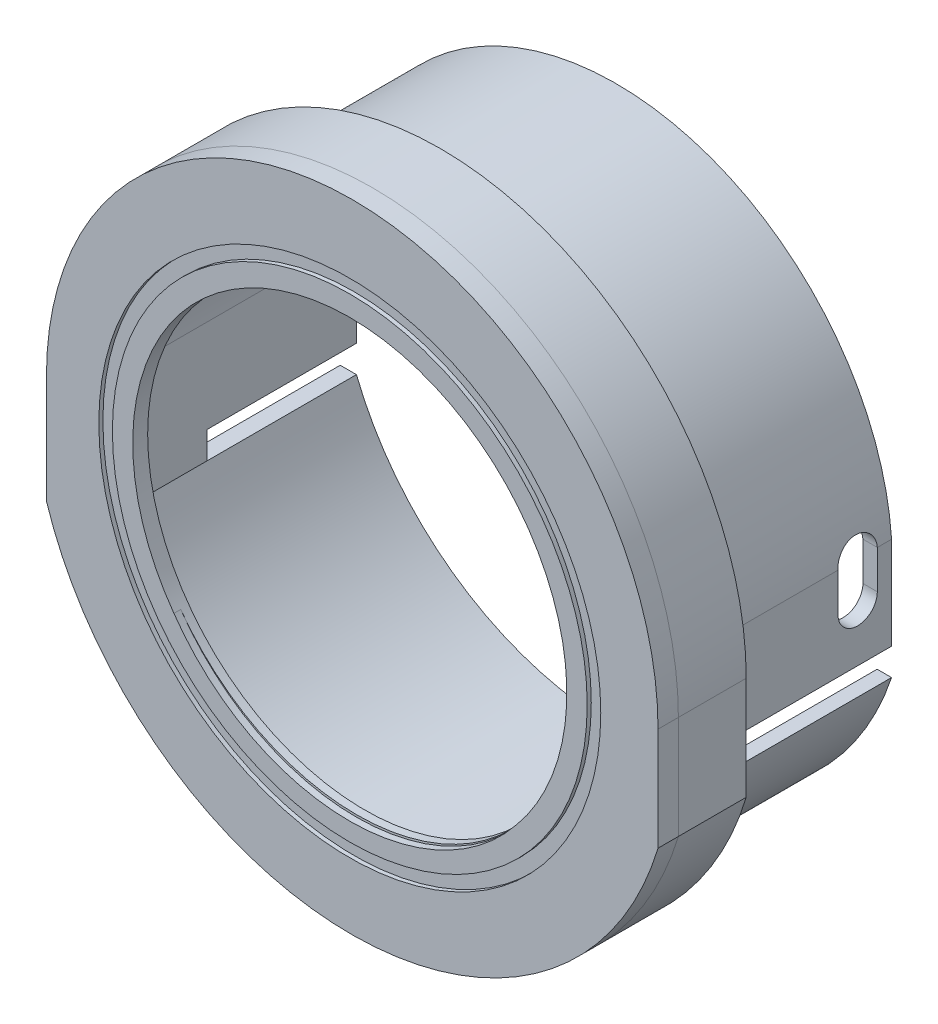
ISO-10303-21;
HEADER;
FILE_DESCRIPTION(('STEP AP214'),'2;1');
FILE_NAME('part.step','',(''),(''),'','','');
FILE_SCHEMA(('AUTOMOTIVE_DESIGN { 1 0 10303 214 1 1 1 1 }'));
ENDSEC;
DATA;
#1=APPLICATION_CONTEXT('core data for automotive mechanical design processes');
#2=APPLICATION_PROTOCOL_DEFINITION('international standard','automotive_design',2000,#1);
#3=PRODUCT_CONTEXT('',#1,'mechanical');
#4=PRODUCT('Part','Part','',(#3));
#5=PRODUCT_RELATED_PRODUCT_CATEGORY('part','',(#4));
#6=PRODUCT_DEFINITION_FORMATION('','',#4);
#7=PRODUCT_DEFINITION_CONTEXT('part definition',#1,'design');
#8=PRODUCT_DEFINITION('design','',#6,#7);
#9=PRODUCT_DEFINITION_SHAPE('','',#8);
#10=(LENGTH_UNIT() NAMED_UNIT(*) SI_UNIT(.MILLI.,.METRE.));
#11=(NAMED_UNIT(*) PLANE_ANGLE_UNIT() SI_UNIT($,.RADIAN.));
#12=(NAMED_UNIT(*) SI_UNIT($,.STERADIAN.) SOLID_ANGLE_UNIT());
#13=UNCERTAINTY_MEASURE_WITH_UNIT(LENGTH_MEASURE(1.E-05),#10,'distance_accuracy_value','');
#14=(GEOMETRIC_REPRESENTATION_CONTEXT(3) GLOBAL_UNCERTAINTY_ASSIGNED_CONTEXT((#13)) GLOBAL_UNIT_ASSIGNED_CONTEXT((#10,
#11,#12)) REPRESENTATION_CONTEXT('',''));
#15=CARTESIAN_POINT('',(0.,0.,0.));
#16=DIRECTION('',(0.,0.,1.));
#17=DIRECTION('',(1.,0.,0.));
#18=AXIS2_PLACEMENT_3D('',#15,#16,#17);
#19=CARTESIAN_POINT('',(-21.0659519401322,-9.2462256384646,-7.));
#20=DIRECTION('',(0.,-1.,0.));
#21=DIRECTION('',(0.,0.,-1.));
#22=AXIS2_PLACEMENT_3D('',#19,#20,#21);
#23=PLANE('',#22);
#24=DIRECTION('',(-1.,0.,0.));
#25=VECTOR('',#24,1.);
#26=CARTESIAN_POINT('',(-21.0659519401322,-9.2462256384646,-18.));
#27=LINE('',#26,#25);
#28=CARTESIAN_POINT('',(-19.8703513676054,-9.2462256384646,-18.));
#29=VERTEX_POINT('',#28);
#30=CARTESIAN_POINT('',(-21.0659519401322,-9.2462256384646,-18.));
#31=VERTEX_POINT('',#30);
#32=EDGE_CURVE('E318',#29,#31,#27,.T.);
#33=ORIENTED_EDGE('',*,*,#32,.T.);
#34=DIRECTION('',(0.,0.,1.));
#35=VECTOR('',#34,1.);
#36=CARTESIAN_POINT('',(-21.0659519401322,-9.2462256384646,-18.));
#37=LINE('',#36,#35);
#38=CARTESIAN_POINT('',(-21.0659519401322,-9.2462256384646,-7.));
#39=VERTEX_POINT('',#38);
#40=EDGE_CURVE('E364',#31,#39,#37,.T.);
#41=ORIENTED_EDGE('',*,*,#40,.T.);
#42=DIRECTION('',(-1.,0.,0.));
#43=VECTOR('',#42,1.);
#44=CARTESIAN_POINT('',(-21.0659519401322,-9.2462256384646,-7.));
#45=LINE('',#44,#43);
#46=CARTESIAN_POINT('',(-19.8703513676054,-9.2462256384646,-7.));
#47=VERTEX_POINT('',#46);
#48=EDGE_CURVE('E315',#47,#39,#45,.T.);
#49=ORIENTED_EDGE('',*,*,#48,.F.);
#50=DIRECTION('',(0.,0.,1.));
#51=VECTOR('',#50,1.);
#52=CARTESIAN_POINT('',(-19.8703513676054,-9.2462256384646,-18.));
#53=LINE('',#52,#51);
#54=EDGE_CURVE('E339',#29,#47,#53,.T.);
#55=ORIENTED_EDGE('',*,*,#54,.F.);
#56=EDGE_LOOP('',(#33,#41,#49,#55));
#57=FACE_BOUND('',#56,.T.);
#58=ADVANCED_FACE('F57',(#57),#23,.F.);
#59=CARTESIAN_POINT('',(-0.734817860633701,-1.45798683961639,-18.));
#60=DIRECTION('',(0.,0.,1.));
#61=DIRECTION('',(1.,0.,0.));
#62=AXIS2_PLACEMENT_3D('',#59,#60,#61);
#63=PLANE('',#62);
#64=CARTESIAN_POINT('',(-0.753743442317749,-1.64840915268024,-18.));
#65=DIRECTION('',(0.,0.,-1.));
#66=DIRECTION('',(-1.,0.,0.));
#67=AXIS2_PLACEMENT_3D('',#64,#65,#66);
#68=CIRCLE('',#67,20.5711330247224);
#69=CARTESIAN_POINT('',(18.5111949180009,-8.86184549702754,-18.));
#70=VERTEX_POINT('',#69);
#71=EDGE_CURVE('E334',#70,#29,#68,.T.);
#72=ORIENTED_EDGE('',*,*,#71,.F.);
#73=DIRECTION('',(-1.,0.,0.));
#74=VECTOR('',#73,1.);
#75=CARTESIAN_POINT('',(19.5746777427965,-8.86184549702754,-18.));
#76=LINE('',#75,#74);
#77=CARTESIAN_POINT('',(19.5746777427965,-8.86184549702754,-18.));
#78=VERTEX_POINT('',#77);
#79=EDGE_CURVE('E304',#78,#70,#76,.T.);
#80=ORIENTED_EDGE('',*,*,#79,.F.);
#81=CARTESIAN_POINT('',(-0.811438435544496,-2.09684013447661,-18.));
#82=DIRECTION('',(0.,0.,-1.));
#83=DIRECTION('',(-1.,0.,0.));
#84=AXIS2_PLACEMENT_3D('',#81,#82,#83);
#85=CIRCLE('',#84,21.4792697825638);
#86=EDGE_CURVE('E354',#78,#31,#85,.T.);
#87=ORIENTED_EDGE('',*,*,#86,.T.);
#88=ORIENTED_EDGE('',*,*,#32,.F.);
#89=EDGE_LOOP('',(#72,#80,#87,#88));
#90=FACE_BOUND('',#89,.T.);
#91=ADVANCED_FACE('F456',(#90),#63,.F.);
#92=CARTESIAN_POINT('',(19.5746777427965,-8.86184549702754,-7.));
#93=DIRECTION('',(0.,-1.,0.));
#94=DIRECTION('',(0.,0.,-1.));
#95=AXIS2_PLACEMENT_3D('',#92,#93,#94);
#96=PLANE('',#95);
#97=ORIENTED_EDGE('',*,*,#79,.T.);
#98=DIRECTION('',(0.,0.,1.));
#99=VECTOR('',#98,1.);
#100=CARTESIAN_POINT('',(18.5111949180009,-8.86184549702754,-18.));
#101=LINE('',#100,#99);
#102=CARTESIAN_POINT('',(18.5111949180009,-8.86184549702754,-7.));
#103=VERTEX_POINT('',#102);
#104=EDGE_CURVE('E343',#70,#103,#101,.T.);
#105=ORIENTED_EDGE('',*,*,#104,.T.);
#106=DIRECTION('',(-1.,0.,0.));
#107=VECTOR('',#106,1.);
#108=CARTESIAN_POINT('',(19.5746777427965,-8.86184549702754,-7.));
#109=LINE('',#108,#107);
#110=CARTESIAN_POINT('',(19.5746777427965,-8.86184549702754,-7.));
#111=VERTEX_POINT('',#110);
#112=EDGE_CURVE('E294',#111,#103,#109,.T.);
#113=ORIENTED_EDGE('',*,*,#112,.F.);
#114=DIRECTION('',(0.,0.,1.));
#115=VECTOR('',#114,1.);
#116=CARTESIAN_POINT('',(19.5746777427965,-8.86184549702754,-18.));
#117=LINE('',#116,#115);
#118=EDGE_CURVE('E367',#78,#111,#117,.T.);
#119=ORIENTED_EDGE('',*,*,#118,.F.);
#120=EDGE_LOOP('',(#97,#105,#113,#119));
#121=FACE_BOUND('',#120,.T.);
#122=ADVANCED_FACE('F452',(#121),#96,.F.);
#123=CARTESIAN_POINT('',(18.5111949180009,-8.86184549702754,-18.));
#124=DIRECTION('',(-1.,0.,0.));
#125=DIRECTION('',(0.,0.,1.));
#126=AXIS2_PLACEMENT_3D('',#123,#124,#125);
#127=PLANE('',#126);
#128=DIRECTION('',(0.,1.,0.));
#129=VECTOR('',#128,1.);
#130=CARTESIAN_POINT('',(18.5111949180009,-8.86184549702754,-14.05));
#131=LINE('',#130,#129);
#132=CARTESIAN_POINT('',(18.5111949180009,-2.86184549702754,-14.05));
#133=VERTEX_POINT('',#132);
#134=CARTESIAN_POINT('',(18.5111949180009,-0.0324930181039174,-14.05));
#135=VERTEX_POINT('',#134);
#136=EDGE_CURVE('E66',#133,#135,#131,.T.);
#137=ORIENTED_EDGE('',*,*,#136,.F.);
#138=CARTESIAN_POINT('',(18.5111949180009,-2.86184549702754,-15.5));
#139=DIRECTION('',(-1.,0.,0.));
#140=DIRECTION('',(0.,0.,1.));
#141=AXIS2_PLACEMENT_3D('',#138,#139,#140);
#142=CIRCLE('',#141,1.45);
#143=CARTESIAN_POINT('',(18.5111949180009,-2.86184549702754,-16.95));
#144=VERTEX_POINT('',#143);
#145=EDGE_CURVE('E376',#144,#133,#142,.T.);
#146=ORIENTED_EDGE('',*,*,#145,.F.);
#147=DIRECTION('',(0.,-1.,0.));
#148=VECTOR('',#147,1.);
#149=CARTESIAN_POINT('',(18.5111949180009,-8.86184549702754,-16.95));
#150=LINE('',#149,#148);
#151=CARTESIAN_POINT('',(18.5111949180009,-0.0324930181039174,-16.95));
#152=VERTEX_POINT('',#151);
#153=EDGE_CURVE('E374',#152,#144,#150,.T.);
#154=ORIENTED_EDGE('',*,*,#153,.F.);
#155=DIRECTION('',(0.,0.,1.));
#156=VECTOR('',#155,1.);
#157=CARTESIAN_POINT('',(18.5111949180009,-0.0324930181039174,-18.));
#158=LINE('',#157,#156);
#159=CARTESIAN_POINT('',(18.5111949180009,-0.0324930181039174,-18.));
#160=VERTEX_POINT('',#159);
#161=EDGE_CURVE('E345',#160,#152,#158,.T.);
#162=ORIENTED_EDGE('',*,*,#161,.F.);
#163=DIRECTION('',(0.,-1.,0.));
#164=VECTOR('',#163,1.);
#165=CARTESIAN_POINT('',(18.5111949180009,-8.86184549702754,-18.));
#166=LINE('',#165,#164);
#167=CARTESIAN_POINT('',(18.5111949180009,-6.86184549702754,-18.));
#168=VERTEX_POINT('',#167);
#169=EDGE_CURVE('E331',#160,#168,#166,.T.);
#170=ORIENTED_EDGE('',*,*,#169,.T.);
#171=DIRECTION('',(0.,0.,-1.));
#172=VECTOR('',#171,1.);
#173=CARTESIAN_POINT('',(18.5111949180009,-6.86184549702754,-7.));
#174=LINE('',#173,#172);
#175=CARTESIAN_POINT('',(18.5111949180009,-6.86184549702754,-7.));
#176=VERTEX_POINT('',#175);
#177=EDGE_CURVE('E303',#176,#168,#174,.T.);
#178=ORIENTED_EDGE('',*,*,#177,.F.);
#179=DIRECTION('',(0.,1.,0.));
#180=VECTOR('',#179,1.);
#181=CARTESIAN_POINT('',(18.5111949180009,-6.86184549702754,-7.));
#182=LINE('',#181,#180);
#183=EDGE_CURVE('E298',#103,#176,#182,.T.);
#184=ORIENTED_EDGE('',*,*,#183,.F.);
#185=CARTESIAN_POINT('',(18.5111949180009,-8.86184549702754,0.));
#186=VERTEX_POINT('',#185);
#187=EDGE_CURVE('E342',#103,#186,#101,.T.);
#188=ORIENTED_EDGE('',*,*,#187,.T.);
#189=DIRECTION('',(0.,1.,0.));
#190=VECTOR('',#189,1.);
#191=CARTESIAN_POINT('',(18.5111949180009,-0.0324930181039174,0.));
#192=LINE('',#191,#190);
#193=CARTESIAN_POINT('',(18.5111949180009,-0.0324930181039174,0.));
#194=VERTEX_POINT('',#193);
#195=EDGE_CURVE('E220',#186,#194,#192,.T.);
#196=ORIENTED_EDGE('',*,*,#195,.T.);
#197=EDGE_CURVE('E211',#135,#194,#158,.T.);
#198=ORIENTED_EDGE('',*,*,#197,.F.);
#199=EDGE_LOOP('',(#137,#146,#154,#162,#170,#178,#184,#188,#196,#198));
#200=FACE_BOUND('',#199,.T.);
#201=ADVANCED_FACE('F392',(#200),#127,.T.);
#202=CARTESIAN_POINT('',(-0.753743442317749,-1.64840915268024,-18.));
#203=DIRECTION('',(0.,0.,1.));
#204=DIRECTION('',(1.,0.,0.));
#205=AXIS2_PLACEMENT_3D('',#202,#203,#204);
#206=CYLINDRICAL_SURFACE('',#205,20.5711330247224);
#207=CARTESIAN_POINT('',(-19.8703513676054,-9.24622563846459,0.));
#208=VERTEX_POINT('',#207);
#209=EDGE_CURVE('E338',#47,#208,#53,.T.);
#210=ORIENTED_EDGE('',*,*,#209,.T.);
#211=CARTESIAN_POINT('',(-0.753743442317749,-1.64840915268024,0.));
#212=DIRECTION('',(0.,0.,1.));
#213=DIRECTION('',(1.,0.,0.));
#214=AXIS2_PLACEMENT_3D('',#211,#212,#213);
#215=CIRCLE('',#214,20.5711330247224);
#216=EDGE_CURVE('E218',#208,#186,#215,.T.);
#217=ORIENTED_EDGE('',*,*,#216,.T.);
#218=ORIENTED_EDGE('',*,*,#187,.F.);
#219=ORIENTED_EDGE('',*,*,#104,.F.);
#220=ORIENTED_EDGE('',*,*,#71,.T.);
#221=ORIENTED_EDGE('',*,*,#54,.T.);
#222=EDGE_LOOP('',(#210,#217,#218,#219,#220,#221));
#223=FACE_BOUND('',#222,.T.);
#224=ADVANCED_FACE('F398',(#223),#206,.F.);
#225=CARTESIAN_POINT('',(-0.667620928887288,-1.51266022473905,-18.));
#226=DIRECTION('',(0.,0.,1.));
#227=DIRECTION('',(1.,0.,0.));
#228=AXIS2_PLACEMENT_3D('',#225,#226,#227);
#229=CYLINDRICAL_SURFACE('',#228,19.2358486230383);
#230=CARTESIAN_POINT('',(-19.8703513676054,-0.384380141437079,-16.6660713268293));
#231=CARTESIAN_POINT('',(-19.8684235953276,-0.351567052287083,-16.6418186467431));
#232=CARTESIAN_POINT('',(-19.8664721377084,-0.319794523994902,-16.6161929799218));
#233=CARTESIAN_POINT('',(-19.8625668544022,-0.25852151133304,-16.5623584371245));
#234=CARTESIAN_POINT('',(-19.8606130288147,-0.229020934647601,-16.5341496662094));
#235=CARTESIAN_POINT('',(-19.8548208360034,-0.144291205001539,-16.445974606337));
#236=CARTESIAN_POINT('',(-19.8510459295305,-0.0927382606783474,-16.3823886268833));
#237=CARTESIAN_POINT('',(-19.8440384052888,-0.0010341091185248,-16.2474394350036));
#238=CARTESIAN_POINT('',(-19.8408060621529,0.0391113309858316,-16.176072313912));
#239=CARTESIAN_POINT('',(-19.8352036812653,0.106846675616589,-16.02758729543));
#240=CARTESIAN_POINT('',(-19.8328334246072,0.134439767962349,-15.9504708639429));
#241=CARTESIAN_POINT('',(-19.8291960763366,0.17623107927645,-15.7928368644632));
#242=CARTESIAN_POINT('',(-19.8279267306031,0.19045667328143,-15.7123266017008));
#243=CARTESIAN_POINT('',(-19.8266106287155,0.205199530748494,-15.5500379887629));
#244=CARTESIAN_POINT('',(-19.8265640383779,0.205714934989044,-15.4682594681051));
#245=CARTESIAN_POINT('',(-19.8276967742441,0.193037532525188,-15.3060394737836));
#246=CARTESIAN_POINT('',(-19.8288722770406,0.179887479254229,-15.2255946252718));
#247=CARTESIAN_POINT('',(-19.8323256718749,0.140323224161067,-15.0680537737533));
#248=CARTESIAN_POINT('',(-19.8346036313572,0.113908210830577,-14.9909579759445));
#249=CARTESIAN_POINT('',(-19.8400384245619,0.0485419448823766,-14.8422093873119));
#250=CARTESIAN_POINT('',(-19.8431963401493,0.00957525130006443,-14.7705634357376));
#251=CARTESIAN_POINT('',(-19.8500794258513,-0.0797774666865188,-14.634849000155));
#252=CARTESIAN_POINT('',(-19.8538041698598,-0.13015492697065,-14.5707748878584));
#253=CARTESIAN_POINT('',(-19.8597305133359,-0.215845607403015,-14.4788204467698));
#254=CARTESIAN_POINT('',(-19.8618614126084,-0.247705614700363,-14.4476497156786));
#255=CARTESIAN_POINT('',(-19.8661214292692,-0.314095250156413,-14.3884212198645));
#256=CARTESIAN_POINT('',(-19.8682505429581,-0.348619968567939,-14.3603579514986));
#257=CARTESIAN_POINT('',(-19.8703513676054,-0.384380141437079,-14.3339286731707));
#258=B_SPLINE_CURVE_WITH_KNOTS('',3,(#230,#231,#232,#233,#234,#235,#236,#237,#238,#239,#240,
#241,#242,#243,#244,#245,#246,#247,#248,#249,#250,#251,#252,#253,#254,#255,#256,#257),
.UNSPECIFIED.,.F.,.F.,(4,2,2,2,2,2,2,2,2,2,2,2,2,4),(0.,0.122470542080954,0.244936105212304,
0.489513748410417,0.734214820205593,0.978853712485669,1.22299051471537,1.46716042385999,
1.71056872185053,1.95399191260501,2.19771571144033,2.44125719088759,2.57495858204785,
2.70841925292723),.UNSPECIFIED.);
#259=CARTESIAN_POINT('',(-19.8703513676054,-0.384380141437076,-16.6660713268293));
#260=VERTEX_POINT('',#259);
#261=CARTESIAN_POINT('',(-19.8703513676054,-0.384380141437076,-14.3339286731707));
#262=VERTEX_POINT('',#261);
#263=EDGE_CURVE('E78',#260,#262,#258,.T.);
#264=ORIENTED_EDGE('',*,*,#263,.F.);
#265=DIRECTION('',(0.,0.,1.));
#266=VECTOR('',#265,1.);
#267=CARTESIAN_POINT('',(-19.8703513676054,-0.384380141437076,-18.));
#268=LINE('',#267,#266);
#269=CARTESIAN_POINT('',(-19.8703513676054,-0.384380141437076,-18.));
#270=VERTEX_POINT('',#269);
#271=EDGE_CURVE('E203',#270,#260,#268,.T.);
#272=ORIENTED_EDGE('',*,*,#271,.F.);
#273=CARTESIAN_POINT('',(-0.667620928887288,-1.51266022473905,-18.));
#274=DIRECTION('',(0.,0.,-1.));
#275=DIRECTION('',(1.,0.,0.));
#276=AXIS2_PLACEMENT_3D('',#273,#274,#275);
#277=CIRCLE('',#276,19.2358486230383);
#278=EDGE_CURVE('E311',#270,#160,#277,.T.);
#279=ORIENTED_EDGE('',*,*,#278,.T.);
#280=ORIENTED_EDGE('',*,*,#161,.T.);
#281=CARTESIAN_POINT('',(18.5111949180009,-0.0324930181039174,-14.05));
#282=CARTESIAN_POINT('',(18.5080334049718,0.0084809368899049,-14.0500002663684));
#283=CARTESIAN_POINT('',(18.5047404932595,0.0494245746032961,-14.0517378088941));
#284=CARTESIAN_POINT('',(18.4979194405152,0.130995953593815,-14.0586643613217));
#285=CARTESIAN_POINT('',(18.4943913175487,0.171623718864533,-14.063853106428));
#286=CARTESIAN_POINT('',(18.4835071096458,0.292522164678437,-14.084538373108));
#287=CARTESIAN_POINT('',(18.4758402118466,0.371949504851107,-14.1051541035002));
#288=CARTESIAN_POINT('',(18.4600337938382,0.526144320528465,-14.1594341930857));
#289=CARTESIAN_POINT('',(18.4518941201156,0.600910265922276,-14.193102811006));
#290=CARTESIAN_POINT('',(18.4355679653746,0.743711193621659,-14.2725320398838));
#291=CARTESIAN_POINT('',(18.4273814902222,0.811747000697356,-14.3182911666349));
#292=CARTESIAN_POINT('',(18.4114172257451,0.939344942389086,-14.4207663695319));
#293=CARTESIAN_POINT('',(18.4036405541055,0.998884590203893,-14.4775106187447));
#294=CARTESIAN_POINT('',(18.3890100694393,1.10758840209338,-14.6003120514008));
#295=CARTESIAN_POINT('',(18.38215636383,1.15675135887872,-14.6663703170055));
#296=CARTESIAN_POINT('',(18.3698590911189,1.24308435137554,-14.8056722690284));
#297=CARTESIAN_POINT('',(18.3644101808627,1.28029996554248,-14.8788872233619));
#298=CARTESIAN_POINT('',(18.3552719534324,1.3418789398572,-15.0306337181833));
#299=CARTESIAN_POINT('',(18.3515824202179,1.36624387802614,-15.1091646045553));
#300=CARTESIAN_POINT('',(18.3462581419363,1.40120103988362,-15.2684725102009));
#301=CARTESIAN_POINT('',(18.3446031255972,1.41192917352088,-15.3492190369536));
#302=CARTESIAN_POINT('',(18.3434011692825,1.41973262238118,-15.5113846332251));
#303=CARTESIAN_POINT('',(18.343854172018,1.41680830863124,-15.5928036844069));
#304=CARTESIAN_POINT('',(18.3468245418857,1.39746486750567,-15.7534140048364));
#305=CARTESIAN_POINT('',(18.3493277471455,1.38113831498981,-15.8326167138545));
#306=CARTESIAN_POINT('',(18.3562010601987,1.33560151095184,-15.9871400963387));
#307=CARTESIAN_POINT('',(18.360571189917,1.30639110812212,-16.0624607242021));
#308=CARTESIAN_POINT('',(18.3708921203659,1.23582349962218,-16.2073837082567));
#309=CARTESIAN_POINT('',(18.3768483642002,1.19442441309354,-16.2769652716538));
#310=CARTESIAN_POINT('',(18.3899338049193,1.10071132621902,-16.4082128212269));
#311=CARTESIAN_POINT('',(18.3970630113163,1.04839723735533,-16.4698787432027));
#312=CARTESIAN_POINT('',(18.4121150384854,0.933748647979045,-16.5842029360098));
#313=CARTESIAN_POINT('',(18.420045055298,0.871319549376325,-16.6367653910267));
#314=CARTESIAN_POINT('',(18.4361598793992,0.738538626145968,-16.7307009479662));
#315=CARTESIAN_POINT('',(18.4443447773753,0.668183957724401,-16.7720700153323));
#316=CARTESIAN_POINT('',(18.4605701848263,0.520982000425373,-16.8427154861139));
#317=CARTESIAN_POINT('',(18.4686091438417,0.444089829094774,-16.8718985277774));
#318=CARTESIAN_POINT('',(18.4840677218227,0.286487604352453,-16.9168429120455));
#319=CARTESIAN_POINT('',(18.4914882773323,0.205783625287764,-16.9326248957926));
#320=CARTESIAN_POINT('',(18.5006673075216,0.0983308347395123,-16.9443256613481));
#321=CARTESIAN_POINT('',(18.5028459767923,0.0721943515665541,-16.9464542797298));
#322=CARTESIAN_POINT('',(18.5070988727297,0.0198792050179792,-16.9492895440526));
#323=CARTESIAN_POINT('',(18.5091732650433,-0.00629931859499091,-16.9499985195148));
#324=CARTESIAN_POINT('',(18.5111949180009,-0.0324930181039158,-16.95));
#325=B_SPLINE_CURVE_WITH_KNOTS('',3,(#281,#282,#283,#284,#285,#286,#287,#288,#289,#290,#291,
#292,#293,#294,#295,#296,#297,#298,#299,#300,#301,#302,#303,#304,#305,#306,#307,#308,#309,#310,
#311,#312,#313,#314,#315,#316,#317,#318,#319,#320,#321,#322,#323,#324),.UNSPECIFIED.,.F.,.F.,(4,
2,2,2,2,2,2,2,2,2,2,2,2,2,2,2,2,2,2,2,2,4),(0.,0.123210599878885,0.24641174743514,
0.492393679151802,0.73845593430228,0.98448799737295,1.23115961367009,1.47785991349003,
1.72360756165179,1.96932502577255,2.21257386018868,2.45581608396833,2.69739213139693,
2.93897101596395,3.18138986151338,3.42381067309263,3.66864557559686,3.91356860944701,
4.16033511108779,4.40672083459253,4.48563351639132,4.56441660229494),.UNSPECIFIED.);
#326=EDGE_CURVE('E276',#135,#152,#325,.T.);
#327=ORIENTED_EDGE('',*,*,#326,.F.);
#328=ORIENTED_EDGE('',*,*,#197,.T.);
#329=CARTESIAN_POINT('',(-0.667620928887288,-1.51266022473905,0.));
#330=DIRECTION('',(0.,0.,1.));
#331=DIRECTION('',(1.,0.,0.));
#332=AXIS2_PLACEMENT_3D('',#329,#330,#331);
#333=CIRCLE('',#332,19.2358486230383);
#334=CARTESIAN_POINT('',(-19.8703513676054,-0.384380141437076,0.));
#335=VERTEX_POINT('',#334);
#336=EDGE_CURVE('E207',#194,#335,#333,.T.);
#337=ORIENTED_EDGE('',*,*,#336,.T.);
#338=EDGE_CURVE('E194',#262,#335,#268,.T.);
#339=ORIENTED_EDGE('',*,*,#338,.F.);
#340=EDGE_LOOP('',(#264,#272,#279,#280,#327,#328,#337,#339));
#341=FACE_BOUND('',#340,.T.);
#342=ADVANCED_FACE('F208',(#341),#229,.F.);
#343=CARTESIAN_POINT('',(16.5746777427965,-0.0324930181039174,-14.05));
#344=DIRECTION('',(0.,0.,1.));
#345=DIRECTION('',(1.,0.,0.));
#346=AXIS2_PLACEMENT_3D('',#343,#344,#345);
#347=PLANE('',#346);
#348=ORIENTED_EDGE('',*,*,#136,.T.);
#349=DIRECTION('',(1.,0.,0.));
#350=VECTOR('',#349,1.);
#351=CARTESIAN_POINT('',(16.5746777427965,-0.0324930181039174,-14.05));
#352=LINE('',#351,#350);
#353=CARTESIAN_POINT('',(19.5746777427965,-0.0324930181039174,-14.05));
#354=VERTEX_POINT('',#353);
#355=EDGE_CURVE('E382',#135,#354,#352,.T.);
#356=ORIENTED_EDGE('',*,*,#355,.T.);
#357=DIRECTION('',(0.,-1.,0.));
#358=VECTOR('',#357,1.);
#359=CARTESIAN_POINT('',(19.5746777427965,-0.0324930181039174,-14.05));
#360=LINE('',#359,#358);
#361=CARTESIAN_POINT('',(19.5746777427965,-2.86184549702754,-14.05));
#362=VERTEX_POINT('',#361);
#363=EDGE_CURVE('E483',#354,#362,#360,.T.);
#364=ORIENTED_EDGE('',*,*,#363,.T.);
#365=DIRECTION('',(1.,0.,0.));
#366=VECTOR('',#365,1.);
#367=CARTESIAN_POINT('',(16.5746777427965,-2.86184549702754,-14.05));
#368=LINE('',#367,#366);
#369=EDGE_CURVE('E384',#133,#362,#368,.T.);
#370=ORIENTED_EDGE('',*,*,#369,.F.);
#371=EDGE_LOOP('',(#348,#356,#364,#370));
#372=FACE_BOUND('',#371,.T.);
#373=ADVANCED_FACE('F260',(#372),#347,.F.);
#374=CARTESIAN_POINT('',(16.5746777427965,-2.86184549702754,-15.5));
#375=DIRECTION('',(1.,0.,0.));
#376=DIRECTION('',(0.,0.,-1.));
#377=AXIS2_PLACEMENT_3D('',#374,#375,#376);
#378=CYLINDRICAL_SURFACE('',#377,1.45);
#379=ORIENTED_EDGE('',*,*,#145,.T.);
#380=ORIENTED_EDGE('',*,*,#369,.T.);
#381=CARTESIAN_POINT('',(19.5746777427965,-2.86184549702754,-15.5));
#382=DIRECTION('',(1.,0.,0.));
#383=DIRECTION('',(0.,0.,-1.));
#384=AXIS2_PLACEMENT_3D('',#381,#382,#383);
#385=CIRCLE('',#384,1.45);
#386=CARTESIAN_POINT('',(19.5746777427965,-2.86184549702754,-16.95));
#387=VERTEX_POINT('',#386);
#388=EDGE_CURVE('E487',#362,#387,#385,.T.);
#389=ORIENTED_EDGE('',*,*,#388,.T.);
#390=DIRECTION('',(1.,0.,0.));
#391=VECTOR('',#390,1.);
#392=CARTESIAN_POINT('',(16.5746777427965,-2.86184549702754,-16.95));
#393=LINE('',#392,#391);
#394=EDGE_CURVE('E477',#144,#387,#393,.T.);
#395=ORIENTED_EDGE('',*,*,#394,.F.);
#396=EDGE_LOOP('',(#379,#380,#389,#395));
#397=FACE_BOUND('',#396,.T.);
#398=ADVANCED_FACE('F264',(#397),#378,.F.);
#399=CARTESIAN_POINT('',(16.5746777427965,-2.86184549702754,-16.95));
#400=DIRECTION('',(0.,0.,-1.));
#401=DIRECTION('',(-1.,0.,0.));
#402=AXIS2_PLACEMENT_3D('',#399,#400,#401);
#403=PLANE('',#402);
#404=ORIENTED_EDGE('',*,*,#153,.T.);
#405=ORIENTED_EDGE('',*,*,#394,.T.);
#406=DIRECTION('',(0.,1.,0.));
#407=VECTOR('',#406,1.);
#408=CARTESIAN_POINT('',(19.5746777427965,-2.86184549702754,-16.95));
#409=LINE('',#408,#407);
#410=CARTESIAN_POINT('',(19.5746777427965,-0.0324930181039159,-16.95));
#411=VERTEX_POINT('',#410);
#412=EDGE_CURVE('E481',#387,#411,#409,.T.);
#413=ORIENTED_EDGE('',*,*,#412,.T.);
#414=DIRECTION('',(1.,0.,0.));
#415=VECTOR('',#414,1.);
#416=CARTESIAN_POINT('',(16.5746777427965,-0.0324930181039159,-16.95));
#417=LINE('',#416,#415);
#418=EDGE_CURVE('E389',#152,#411,#417,.T.);
#419=ORIENTED_EDGE('',*,*,#418,.F.);
#420=EDGE_LOOP('',(#404,#405,#413,#419));
#421=FACE_BOUND('',#420,.T.);
#422=ADVANCED_FACE('F272',(#421),#403,.F.);
#423=CARTESIAN_POINT('',(19.5746777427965,-6.86184549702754,-7.));
#424=DIRECTION('',(0.,1.,0.));
#425=DIRECTION('',(0.,0.,1.));
#426=AXIS2_PLACEMENT_3D('',#423,#424,#425);
#427=PLANE('',#426);
#428=DIRECTION('',(1.,0.,0.));
#429=VECTOR('',#428,1.);
#430=CARTESIAN_POINT('',(19.5746777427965,-6.86184549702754,-18.));
#431=LINE('',#430,#429);
#432=CARTESIAN_POINT('',(19.5746777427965,-6.86184549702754,-18.));
#433=VERTEX_POINT('',#432);
#434=EDGE_CURVE('E295',#168,#433,#431,.T.);
#435=ORIENTED_EDGE('',*,*,#434,.T.);
#436=DIRECTION('',(0.,0.,-1.));
#437=VECTOR('',#436,1.);
#438=CARTESIAN_POINT('',(19.5746777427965,-6.86184549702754,-7.));
#439=LINE('',#438,#437);
#440=CARTESIAN_POINT('',(19.5746777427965,-6.86184549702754,-7.));
#441=VERTEX_POINT('',#440);
#442=EDGE_CURVE('E308',#441,#433,#439,.T.);
#443=ORIENTED_EDGE('',*,*,#442,.F.);
#444=DIRECTION('',(1.,0.,0.));
#445=VECTOR('',#444,1.);
#446=CARTESIAN_POINT('',(19.5746777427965,-6.86184549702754,-7.));
#447=LINE('',#446,#445);
#448=EDGE_CURVE('E300',#176,#441,#447,.T.);
#449=ORIENTED_EDGE('',*,*,#448,.F.);
#450=ORIENTED_EDGE('',*,*,#177,.T.);
#451=EDGE_LOOP('',(#435,#443,#449,#450));
#452=FACE_BOUND('',#451,.T.);
#453=ADVANCED_FACE('F463',(#452),#427,.F.);
#454=CARTESIAN_POINT('',(0.,0.,-7.));
#455=DIRECTION('',(0.,0.,-1.));
#456=DIRECTION('',(-1.,0.,0.));
#457=AXIS2_PLACEMENT_3D('',#454,#455,#456);
#458=PLANE('',#457);
#459=DIRECTION('',(0.,-1.,0.));
#460=VECTOR('',#459,1.);
#461=CARTESIAN_POINT('',(19.5746777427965,-6.86184549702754,-7.));
#462=LINE('',#461,#460);
#463=EDGE_CURVE('E291',#441,#111,#462,.T.);
#464=ORIENTED_EDGE('',*,*,#463,.T.);
#465=ORIENTED_EDGE('',*,*,#112,.T.);
#466=ORIENTED_EDGE('',*,*,#183,.T.);
#467=ORIENTED_EDGE('',*,*,#448,.T.);
#468=EDGE_LOOP('',(#464,#465,#466,#467));
#469=FACE_BOUND('',#468,.T.);
#470=ADVANCED_FACE('F439',(#469),#458,.T.);
#471=CARTESIAN_POINT('',(0.,0.,-7.));
#472=DIRECTION('',(0.,0.,-1.));
#473=DIRECTION('',(-1.,0.,0.));
#474=AXIS2_PLACEMENT_3D('',#471,#472,#473);
#475=PLANE('',#474);
#476=DIRECTION('',(0.,1.,0.));
#477=VECTOR('',#476,1.);
#478=CARTESIAN_POINT('',(-21.0659519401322,-9.2462256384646,-7.));
#479=LINE('',#478,#477);
#480=CARTESIAN_POINT('',(-21.0659519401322,-7.2462256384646,-7.));
#481=VERTEX_POINT('',#480);
#482=EDGE_CURVE('E320',#39,#481,#479,.T.);
#483=ORIENTED_EDGE('',*,*,#482,.T.);
#484=DIRECTION('',(1.,0.,0.));
#485=VECTOR('',#484,1.);
#486=CARTESIAN_POINT('',(-21.0659519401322,-7.2462256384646,-7.));
#487=LINE('',#486,#485);
#488=CARTESIAN_POINT('',(-19.8703513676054,-7.2462256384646,-7.));
#489=VERTEX_POINT('',#488);
#490=EDGE_CURVE('E326',#481,#489,#487,.T.);
#491=ORIENTED_EDGE('',*,*,#490,.T.);
#492=DIRECTION('',(0.,-1.,0.));
#493=VECTOR('',#492,1.);
#494=CARTESIAN_POINT('',(-19.8703513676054,-9.2462256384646,-7.));
#495=LINE('',#494,#493);
#496=EDGE_CURVE('E324',#489,#47,#495,.T.);
#497=ORIENTED_EDGE('',*,*,#496,.T.);
#498=ORIENTED_EDGE('',*,*,#48,.T.);
#499=EDGE_LOOP('',(#483,#491,#497,#498));
#500=FACE_BOUND('',#499,.T.);
#501=ADVANCED_FACE('F404',(#500),#475,.T.);
#502=CARTESIAN_POINT('',(-21.0659519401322,-7.2462256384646,-7.));
#503=DIRECTION('',(0.,1.,0.));
#504=DIRECTION('',(0.,0.,1.));
#505=AXIS2_PLACEMENT_3D('',#502,#503,#504);
#506=PLANE('',#505);
#507=DIRECTION('',(1.,0.,0.));
#508=VECTOR('',#507,1.);
#509=CARTESIAN_POINT('',(-21.0659519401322,-7.2462256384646,-18.));
#510=LINE('',#509,#508);
#511=CARTESIAN_POINT('',(-21.0659519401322,-7.2462256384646,-18.));
#512=VERTEX_POINT('',#511);
#513=CARTESIAN_POINT('',(-19.8703513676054,-7.2462256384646,-18.));
#514=VERTEX_POINT('',#513);
#515=EDGE_CURVE('E306',#512,#514,#510,.T.);
#516=ORIENTED_EDGE('',*,*,#515,.T.);
#517=DIRECTION('',(0.,0.,-1.));
#518=VECTOR('',#517,1.);
#519=CARTESIAN_POINT('',(-19.8703513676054,-7.2462256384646,-7.));
#520=LINE('',#519,#518);
#521=EDGE_CURVE('E290',#489,#514,#520,.T.);
#522=ORIENTED_EDGE('',*,*,#521,.F.);
#523=ORIENTED_EDGE('',*,*,#490,.F.);
#524=DIRECTION('',(0.,0.,-1.));
#525=VECTOR('',#524,1.);
#526=CARTESIAN_POINT('',(-21.0659519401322,-7.2462256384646,-7.));
#527=LINE('',#526,#525);
#528=EDGE_CURVE('E313',#481,#512,#527,.T.);
#529=ORIENTED_EDGE('',*,*,#528,.T.);
#530=EDGE_LOOP('',(#516,#522,#523,#529));
#531=FACE_BOUND('',#530,.T.);
#532=ADVANCED_FACE('F431',(#531),#506,.F.);
#533=CARTESIAN_POINT('',(-0.811438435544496,-2.09684013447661,-18.));
#534=DIRECTION('',(0.,0.,1.));
#535=DIRECTION('',(1.,0.,0.));
#536=AXIS2_PLACEMENT_3D('',#533,#534,#535);
#537=CYLINDRICAL_SURFACE('',#536,21.4792697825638);
#538=CARTESIAN_POINT('',(19.5746777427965,-8.86184549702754,0.));
#539=VERTEX_POINT('',#538);
#540=EDGE_CURVE('E366',#111,#539,#117,.T.);
#541=ORIENTED_EDGE('',*,*,#540,.T.);
#542=CARTESIAN_POINT('',(-0.811438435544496,-2.09684013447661,0.));
#543=DIRECTION('',(0.,0.,1.));
#544=DIRECTION('',(1.,0.,0.));
#545=AXIS2_PLACEMENT_3D('',#542,#543,#544);
#546=CIRCLE('',#545,21.4792697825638);
#547=CARTESIAN_POINT('',(-21.0659519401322,-9.24622563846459,0.));
#548=VERTEX_POINT('',#547);
#549=EDGE_CURVE('E230',#548,#539,#546,.T.);
#550=ORIENTED_EDGE('',*,*,#549,.F.);
#551=EDGE_CURVE('E363',#39,#548,#37,.T.);
#552=ORIENTED_EDGE('',*,*,#551,.F.);
#553=ORIENTED_EDGE('',*,*,#40,.F.);
#554=ORIENTED_EDGE('',*,*,#86,.F.);
#555=ORIENTED_EDGE('',*,*,#118,.T.);
#556=EDGE_LOOP('',(#541,#550,#552,#553,#554,#555));
#557=FACE_BOUND('',#556,.T.);
#558=ADVANCED_FACE('F412',(#557),#537,.T.);
#559=DIRECTION('',(0.,-1.,0.));
#560=VECTOR('',#559,1.);
#561=CARTESIAN_POINT('',(19.5746777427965,-0.0324930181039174,-18.));
#562=LINE('',#561,#560);
#563=CARTESIAN_POINT('',(19.5746777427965,-0.0324930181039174,-18.));
#564=VERTEX_POINT('',#563);
#565=EDGE_CURVE('E351',#564,#433,#562,.T.);
#566=ORIENTED_EDGE('',*,*,#565,.T.);
#567=ORIENTED_EDGE('',*,*,#434,.F.);
#568=ORIENTED_EDGE('',*,*,#169,.F.);
#569=ORIENTED_EDGE('',*,*,#278,.F.);
#570=DIRECTION('',(0.,1.,0.));
#571=VECTOR('',#570,1.);
#572=CARTESIAN_POINT('',(-19.8703513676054,-0.384380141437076,-18.));
#573=LINE('',#572,#571);
#574=EDGE_CURVE('E204',#514,#270,#573,.T.);
#575=ORIENTED_EDGE('',*,*,#574,.F.);
#576=ORIENTED_EDGE('',*,*,#515,.F.);
#577=DIRECTION('',(0.,1.,0.));
#578=VECTOR('',#577,1.);
#579=CARTESIAN_POINT('',(-21.0659519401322,-0.384380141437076,-18.));
#580=LINE('',#579,#578);
#581=CARTESIAN_POINT('',(-21.0659519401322,-0.384380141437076,-18.));
#582=VERTEX_POINT('',#581);
#583=EDGE_CURVE('E357',#512,#582,#580,.T.);
#584=ORIENTED_EDGE('',*,*,#583,.T.);
#585=CARTESIAN_POINT('',(-0.734817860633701,-1.45798683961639,-18.));
#586=DIRECTION('',(0.,0.,-1.));
#587=DIRECTION('',(1.,0.,0.));
#588=AXIS2_PLACEMENT_3D('',#585,#586,#587);
#589=CIRCLE('',#588,20.3594608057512);
#590=EDGE_CURVE('E348',#582,#564,#589,.T.);
#591=ORIENTED_EDGE('',*,*,#590,.T.);
#592=EDGE_LOOP('',(#566,#567,#568,#569,#575,#576,#584,#591));
#593=FACE_BOUND('',#592,.T.);
#594=ADVANCED_FACE('F270',(#593),#63,.F.);
#595=CARTESIAN_POINT('',(16.5746777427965,-0.0324930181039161,-15.5));
#596=DIRECTION('',(1.,0.,0.));
#597=DIRECTION('',(0.,0.,-1.));
#598=AXIS2_PLACEMENT_3D('',#595,#596,#597);
#599=CYLINDRICAL_SURFACE('',#598,1.45);
#600=ORIENTED_EDGE('',*,*,#355,.F.);
#601=ORIENTED_EDGE('',*,*,#326,.T.);
#602=ORIENTED_EDGE('',*,*,#418,.T.);
#603=CARTESIAN_POINT('',(19.5746777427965,-0.0324930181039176,-14.05));
#604=CARTESIAN_POINT('',(19.5718046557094,0.0084507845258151,-14.050000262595));
#605=CARTESIAN_POINT('',(19.5688076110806,0.0493658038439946,-14.0517352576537));
#606=CARTESIAN_POINT('',(19.5625909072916,0.130883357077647,-14.0586523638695));
#607=CARTESIAN_POINT('',(19.5593712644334,0.171485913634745,-14.0638342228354));
#608=CARTESIAN_POINT('',(19.5494269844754,0.29231474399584,-14.0844935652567));
#609=CARTESIAN_POINT('',(19.5424070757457,0.371702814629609,-14.1050849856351));
#610=CARTESIAN_POINT('',(19.5279094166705,0.525832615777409,-14.1593067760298));
#611=CARTESIAN_POINT('',(19.5204315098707,0.600572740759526,-14.1929416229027));
#612=CARTESIAN_POINT('',(19.5054143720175,0.743329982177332,-14.2722936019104));
#613=CARTESIAN_POINT('',(19.4978751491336,0.811347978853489,-14.3180091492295));
#614=CARTESIAN_POINT('',(19.4831622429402,0.9388997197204,-14.4203705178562));
#615=CARTESIAN_POINT('',(19.4759894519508,0.998413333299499,-14.4770415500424));
#616=CARTESIAN_POINT('',(19.4624859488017,1.10708017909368,-14.5996751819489));
#617=CARTESIAN_POINT('',(19.4561553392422,1.15623214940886,-14.6656389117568));
#618=CARTESIAN_POINT('',(19.4447857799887,1.24259451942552,-14.8047771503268));
#619=CARTESIAN_POINT('',(19.4397427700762,1.27984255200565,-14.8779279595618));
#620=CARTESIAN_POINT('',(19.4312796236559,1.34150081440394,-15.0295363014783));
#621=CARTESIAN_POINT('',(19.427859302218,1.36591250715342,-15.1079932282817));
#622=CARTESIAN_POINT('',(19.4229126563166,1.40100935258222,-15.2672682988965));
#623=CARTESIAN_POINT('',(19.4213703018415,1.41181070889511,-15.3480603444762));
#624=CARTESIAN_POINT('',(19.4202393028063,1.41974355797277,-15.5103265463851));
#625=CARTESIAN_POINT('',(19.4206506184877,1.41687532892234,-15.5918006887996));
#626=CARTESIAN_POINT('',(19.4233883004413,1.39761469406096,-15.7526087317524));
#627=CARTESIAN_POINT('',(19.4257033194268,1.38130242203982,-15.8319524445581));
#628=CARTESIAN_POINT('',(19.4320666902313,1.33574477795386,-15.9867606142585));
#629=CARTESIAN_POINT('',(19.4361150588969,1.30649928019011,-16.062225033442));
#630=CARTESIAN_POINT('',(19.4456748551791,1.23582589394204,-16.2073923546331));
#631=CARTESIAN_POINT('',(19.4511906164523,1.19436188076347,-16.2770773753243));
#632=CARTESIAN_POINT('',(19.4633043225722,1.10047704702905,-16.4085163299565));
#633=CARTESIAN_POINT('',(19.4699022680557,1.04805622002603,-16.4702702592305));
#634=CARTESIAN_POINT('',(19.4838135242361,0.933237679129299,-16.5846601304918));
#635=CARTESIAN_POINT('',(19.4911324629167,0.870758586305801,-16.6372137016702));
#636=CARTESIAN_POINT('',(19.5059901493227,0.737872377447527,-16.7311203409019));
#637=CARTESIAN_POINT('',(19.5135289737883,0.667462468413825,-16.7724694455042));
#638=CARTESIAN_POINT('',(19.5284446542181,0.520231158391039,-16.8430217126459));
#639=CARTESIAN_POINT('',(19.5358201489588,0.443371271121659,-16.8721446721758));
#640=CARTESIAN_POINT('',(19.5499767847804,0.285851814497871,-16.9169827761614));
#641=CARTESIAN_POINT('',(19.5567588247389,0.205198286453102,-16.9327185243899));
#642=CARTESIAN_POINT('',(19.5651224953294,0.0978905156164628,-16.9443638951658));
#643=CARTESIAN_POINT('',(19.567102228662,0.0718408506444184,-16.9464782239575));
#644=CARTESIAN_POINT('',(19.570963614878,0.0197011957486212,-16.9492943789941));
#645=CARTESIAN_POINT('',(19.5728454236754,-0.00638865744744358,-16.9499985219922));
#646=CARTESIAN_POINT('',(19.5746777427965,-0.0324930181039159,-16.95));
#647=B_SPLINE_CURVE_WITH_KNOTS('',3,(#603,#604,#605,#606,#607,#608,#609,#610,#611,#612,#613,
#614,#615,#616,#617,#618,#619,#620,#621,#622,#623,#624,#625,#626,#627,#628,#629,#630,#631,#632,
#633,#634,#635,#636,#637,#638,#639,#640,#641,#642,#643,#644,#645,#646),.UNSPECIFIED.,.F.,.F.,(4,
2,2,2,2,2,2,2,2,2,2,2,2,2,2,2,2,2,2,2,2,4),(0.,0.123057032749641,0.246105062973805,
0.491783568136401,0.737546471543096,0.98327715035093,1.22958018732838,1.47591320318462,
1.72145958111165,1.9669779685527,2.21038561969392,2.45378831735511,2.69575060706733,
2.93771524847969,3.18040257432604,3.42309004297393,3.66785004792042,3.91269652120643,
4.15912498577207,4.4051734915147,4.48377700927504,4.56225128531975),.UNSPECIFIED.);
#648=EDGE_CURVE('E283',#354,#411,#647,.T.);
#649=ORIENTED_EDGE('',*,*,#648,.F.);
#650=EDGE_LOOP('',(#600,#601,#602,#649));
#651=FACE_BOUND('',#650,.T.);
#652=ADVANCED_FACE('F266',(#651),#599,.F.);
#653=CARTESIAN_POINT('',(19.5746777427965,-0.0324930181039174,-18.));
#654=DIRECTION('',(-1.,0.,0.));
#655=DIRECTION('',(0.,0.,1.));
#656=AXIS2_PLACEMENT_3D('',#653,#654,#655);
#657=PLANE('',#656);
#658=DIRECTION('',(0.,0.,1.));
#659=VECTOR('',#658,1.);
#660=CARTESIAN_POINT('',(19.5746777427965,-0.0324930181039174,-18.));
#661=LINE('',#660,#659);
#662=CARTESIAN_POINT('',(19.5746777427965,-0.0324930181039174,0.));
#663=VERTEX_POINT('',#662);
#664=EDGE_CURVE('E370',#354,#663,#661,.T.);
#665=ORIENTED_EDGE('',*,*,#664,.T.);
#666=DIRECTION('',(0.,1.,0.));
#667=VECTOR('',#666,1.);
#668=CARTESIAN_POINT('',(19.5746777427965,-0.0324930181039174,0.));
#669=LINE('',#668,#667);
#670=EDGE_CURVE('E233',#539,#663,#669,.T.);
#671=ORIENTED_EDGE('',*,*,#670,.F.);
#672=ORIENTED_EDGE('',*,*,#540,.F.);
#673=ORIENTED_EDGE('',*,*,#463,.F.);
#674=ORIENTED_EDGE('',*,*,#442,.T.);
#675=ORIENTED_EDGE('',*,*,#565,.F.);
#676=EDGE_CURVE('E371',#564,#411,#661,.T.);
#677=ORIENTED_EDGE('',*,*,#676,.T.);
#678=ORIENTED_EDGE('',*,*,#412,.F.);
#679=ORIENTED_EDGE('',*,*,#388,.F.);
#680=ORIENTED_EDGE('',*,*,#363,.F.);
#681=EDGE_LOOP('',(#665,#671,#672,#673,#674,#675,#677,#678,#679,#680));
#682=FACE_BOUND('',#681,.T.);
#683=ADVANCED_FACE('F259',(#682),#657,.F.);
#684=CARTESIAN_POINT('',(-18.0659519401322,-1.2462256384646,-15.5));
#685=DIRECTION('',(-1.,0.,0.));
#686=DIRECTION('',(0.,0.,1.));
#687=AXIS2_PLACEMENT_3D('',#684,#685,#686);
#688=CYLINDRICAL_SURFACE('',#687,1.45);
#689=ORIENTED_EDGE('',*,*,#263,.T.);
#690=CARTESIAN_POINT('',(-19.8703513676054,-1.2462256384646,-15.5));
#691=DIRECTION('',(1.,0.,0.));
#692=DIRECTION('',(0.,0.,-1.));
#693=AXIS2_PLACEMENT_3D('',#690,#691,#692);
#694=CIRCLE('',#693,1.45);
#695=EDGE_CURVE('E13',#262,#260,#694,.T.);
#696=ORIENTED_EDGE('',*,*,#695,.T.);
#697=EDGE_LOOP('',(#689,#696));
#698=FACE_BOUND('',#697,.T.);
#699=CARTESIAN_POINT('',(-21.0659519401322,-1.2462256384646,-15.5));
#700=DIRECTION('',(-1.,0.,0.));
#701=DIRECTION('',(0.,0.,1.));
#702=AXIS2_PLACEMENT_3D('',#699,#700,#701);
#703=CIRCLE('',#702,1.45);
#704=CARTESIAN_POINT('',(-21.0659519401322,-0.384380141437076,-16.6660713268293));
#705=VERTEX_POINT('',#704);
#706=CARTESIAN_POINT('',(-21.0659519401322,-0.384380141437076,-14.3339286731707));
#707=VERTEX_POINT('',#706);
#708=EDGE_CURVE('E236',#705,#707,#703,.T.);
#709=ORIENTED_EDGE('',*,*,#708,.T.);
#710=CARTESIAN_POINT('',(-21.0659519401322,-0.384380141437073,-16.6660713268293));
#711=CARTESIAN_POINT('',(-21.0642194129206,-0.351567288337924,-16.6418188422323));
#712=CARTESIAN_POINT('',(-21.0624617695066,-0.319794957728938,-16.6161933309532));
#713=CARTESIAN_POINT('',(-21.0589382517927,-0.258522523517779,-16.5623593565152));
#714=CARTESIAN_POINT('',(-21.0571723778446,-0.229022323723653,-16.5341510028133));
#715=CARTESIAN_POINT('',(-21.0519303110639,-0.144295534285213,-16.4459793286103));
#716=CARTESIAN_POINT('',(-21.0485043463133,-0.0927454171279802,-16.3823973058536));
#717=CARTESIAN_POINT('',(-21.0421342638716,-0.00104798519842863,-16.2474617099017));
#718=CARTESIAN_POINT('',(-21.039190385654,0.039093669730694,-16.176104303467));
#719=CARTESIAN_POINT('',(-21.0340831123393,0.106823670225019,-16.0276444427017));
#720=CARTESIAN_POINT('',(-21.0319195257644,0.134415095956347,-15.9505434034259));
#721=CARTESIAN_POINT('',(-21.0285969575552,0.176215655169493,-15.7929155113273));
#722=CARTESIAN_POINT('',(-21.0274362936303,0.190447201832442,-15.7123946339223));
#723=CARTESIAN_POINT('',(-21.0262326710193,0.2051984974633,-15.5500855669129));
#724=CARTESIAN_POINT('',(-21.0261898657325,0.205716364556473,-15.4682972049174));
#725=CARTESIAN_POINT('',(-21.0272253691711,0.193037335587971,-15.3060175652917));
#726=CARTESIAN_POINT('',(-21.0283007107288,0.179876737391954,-15.2255234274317));
#727=CARTESIAN_POINT('',(-21.0314579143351,0.140273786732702,-15.0678853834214));
#728=CARTESIAN_POINT('',(-21.0335398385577,0.113830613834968,-14.9907416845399));
#729=CARTESIAN_POINT('',(-21.0385006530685,0.0483938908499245,-14.8419123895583));
#730=CARTESIAN_POINT('',(-21.0413804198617,0.00938653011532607,-14.7702329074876));
#731=CARTESIAN_POINT('',(-21.0476454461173,-0.0800620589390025,-14.634460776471));
#732=CARTESIAN_POINT('',(-21.0510303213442,-0.130494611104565,-14.5703624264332));
#733=CARTESIAN_POINT('',(-21.0563953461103,-0.216191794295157,-14.478475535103));
#734=CARTESIAN_POINT('',(-21.0583179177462,-0.247990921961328,-14.4473831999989));
#735=CARTESIAN_POINT('',(-21.0621542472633,-0.314246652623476,-14.3882981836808));
#736=CARTESIAN_POINT('',(-21.0640680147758,-0.348698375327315,-14.360300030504));
#737=CARTESIAN_POINT('',(-21.0659519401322,-0.384380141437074,-14.3339286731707));
#738=B_SPLINE_CURVE_WITH_KNOTS('',3,(#710,#711,#712,#713,#714,#715,#716,#717,#718,#719,#720,
#721,#722,#723,#724,#725,#726,#727,#728,#729,#730,#731,#732,#733,#734,#735,#736,#737),
.UNSPECIFIED.,.F.,.F.,(4,2,2,2,2,2,2,2,2,2,2,2,2,4),(0.,0.122443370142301,0.244881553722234,
0.489398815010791,0.734037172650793,0.978615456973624,1.2227826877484,1.46698342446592,
1.71053778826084,1.95410719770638,2.19794525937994,2.44159877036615,2.57497822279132,
2.7081178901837),.UNSPECIFIED.);
#739=EDGE_CURVE('E72',#705,#707,#738,.T.);
#740=ORIENTED_EDGE('',*,*,#739,.F.);
#741=EDGE_LOOP('',(#709,#740));
#742=FACE_BOUND('',#741,.T.);
#743=ADVANCED_FACE('F253',(#698,#742),#688,.F.);
#744=CARTESIAN_POINT('',(-21.0659519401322,-0.384380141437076,-18.));
#745=DIRECTION('',(1.,0.,0.));
#746=DIRECTION('',(0.,0.,-1.));
#747=AXIS2_PLACEMENT_3D('',#744,#745,#746);
#748=PLANE('',#747);
#749=ORIENTED_EDGE('',*,*,#551,.T.);
#750=DIRECTION('',(0.,-1.,0.));
#751=VECTOR('',#750,1.);
#752=CARTESIAN_POINT('',(-21.0659519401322,-9.2462256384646,0.));
#753=LINE('',#752,#751);
#754=CARTESIAN_POINT('',(-21.0659519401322,-0.384380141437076,0.));
#755=VERTEX_POINT('',#754);
#756=EDGE_CURVE('E227',#755,#548,#753,.T.);
#757=ORIENTED_EDGE('',*,*,#756,.F.);
#758=DIRECTION('',(0.,0.,1.));
#759=VECTOR('',#758,1.);
#760=CARTESIAN_POINT('',(-21.0659519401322,-0.384380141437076,-18.));
#761=LINE('',#760,#759);
#762=EDGE_CURVE('E359',#707,#755,#761,.T.);
#763=ORIENTED_EDGE('',*,*,#762,.F.);
#764=ORIENTED_EDGE('',*,*,#708,.F.);
#765=EDGE_CURVE('E360',#582,#705,#761,.T.);
#766=ORIENTED_EDGE('',*,*,#765,.F.);
#767=ORIENTED_EDGE('',*,*,#583,.F.);
#768=ORIENTED_EDGE('',*,*,#528,.F.);
#769=ORIENTED_EDGE('',*,*,#482,.F.);
#770=EDGE_LOOP('',(#749,#757,#763,#764,#766,#767,#768,#769));
#771=FACE_BOUND('',#770,.T.);
#772=ADVANCED_FACE('F258',(#771),#748,.F.);
#773=CARTESIAN_POINT('',(-0.734817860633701,-1.45798683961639,-18.));
#774=DIRECTION('',(0.,0.,1.));
#775=DIRECTION('',(1.,0.,0.));
#776=AXIS2_PLACEMENT_3D('',#773,#774,#775);
#777=CYLINDRICAL_SURFACE('',#776,20.3594608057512);
#778=ORIENTED_EDGE('',*,*,#765,.T.);
#779=ORIENTED_EDGE('',*,*,#739,.T.);
#780=ORIENTED_EDGE('',*,*,#762,.T.);
#781=CARTESIAN_POINT('',(-0.734817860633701,-1.45798683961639,0.));
#782=DIRECTION('',(0.,0.,1.));
#783=DIRECTION('',(1.,0.,0.));
#784=AXIS2_PLACEMENT_3D('',#781,#782,#783);
#785=CIRCLE('',#784,20.3594608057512);
#786=EDGE_CURVE('E224',#663,#755,#785,.T.);
#787=ORIENTED_EDGE('',*,*,#786,.F.);
#788=ORIENTED_EDGE('',*,*,#664,.F.);
#789=ORIENTED_EDGE('',*,*,#648,.T.);
#790=ORIENTED_EDGE('',*,*,#676,.F.);
#791=ORIENTED_EDGE('',*,*,#590,.F.);
#792=EDGE_LOOP('',(#778,#779,#780,#787,#788,#789,#790,#791));
#793=FACE_BOUND('',#792,.T.);
#794=ADVANCED_FACE('F59',(#793),#777,.T.);
#795=CARTESIAN_POINT('',(-19.8703513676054,-0.384380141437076,-18.));
#796=DIRECTION('',(1.,0.,0.));
#797=DIRECTION('',(0.,0.,-1.));
#798=AXIS2_PLACEMENT_3D('',#795,#796,#797);
#799=PLANE('',#798);
#800=ORIENTED_EDGE('',*,*,#695,.F.);
#801=ORIENTED_EDGE('',*,*,#338,.T.);
#802=DIRECTION('',(0.,-1.,0.));
#803=VECTOR('',#802,1.);
#804=CARTESIAN_POINT('',(-19.8703513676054,-9.2462256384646,0.));
#805=LINE('',#804,#803);
#806=EDGE_CURVE('E199',#335,#208,#805,.T.);
#807=ORIENTED_EDGE('',*,*,#806,.T.);
#808=ORIENTED_EDGE('',*,*,#209,.F.);
#809=ORIENTED_EDGE('',*,*,#496,.F.);
#810=ORIENTED_EDGE('',*,*,#521,.T.);
#811=ORIENTED_EDGE('',*,*,#574,.T.);
#812=ORIENTED_EDGE('',*,*,#271,.T.);
#813=EDGE_LOOP('',(#800,#801,#807,#808,#809,#810,#811,#812));
#814=FACE_BOUND('',#813,.T.);
#815=ADVANCED_FACE('F196',(#814),#799,.T.);
#816=CARTESIAN_POINT('',(-0.734817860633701,-1.45798683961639,0.));
#817=DIRECTION('',(0.,0.,1.));
#818=DIRECTION('',(1.,0.,0.));
#819=AXIS2_PLACEMENT_3D('',#816,#817,#818);
#820=PLANE('',#819);
#821=ORIENTED_EDGE('',*,*,#786,.T.);
#822=ORIENTED_EDGE('',*,*,#756,.T.);
#823=ORIENTED_EDGE('',*,*,#549,.T.);
#824=ORIENTED_EDGE('',*,*,#670,.T.);
#825=EDGE_LOOP('',(#821,#822,#823,#824));
#826=FACE_BOUND('',#825,.T.);
#827=ORIENTED_EDGE('',*,*,#806,.F.);
#828=ORIENTED_EDGE('',*,*,#336,.F.);
#829=ORIENTED_EDGE('',*,*,#195,.F.);
#830=ORIENTED_EDGE('',*,*,#216,.F.);
#831=EDGE_LOOP('',(#827,#828,#829,#830));
#832=FACE_BOUND('',#831,.T.);
#833=ADVANCED_FACE('F216',(#826,#832),#820,.T.);
#834=CLOSED_SHELL('',(#58,#91,#122,#201,#224,#342,#373,#398,#422,#453,#470,#501,#532,#558,#594,
#652,#683,#743,#772,#794,#815,#833));
#835=MANIFOLD_SOLID_BREP('B2',#834);
#836=CARTESIAN_POINT('',(-0.860046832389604,-2.33739495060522,-8.5));
#837=DIRECTION('',(0.,0.,1.));
#838=DIRECTION('',(1.,0.,0.));
#839=AXIS2_PLACEMENT_3D('',#836,#837,#838);
#840=CYLINDRICAL_SURFACE('',#839,16.);
#841=CARTESIAN_POINT('',(-0.860046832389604,-2.33739495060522,1.));
#842=DIRECTION('',(0.,0.,1.));
#843=DIRECTION('',(1.,0.,0.));
#844=AXIS2_PLACEMENT_3D('',#841,#842,#843);
#845=CIRCLE('',#844,16.);
#846=CARTESIAN_POINT('',(-13.8244369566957,-11.7142061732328,0.99999999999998));
#847=VERTEX_POINT('',#846);
#848=CARTESIAN_POINT('',(11.4029483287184,-12.6145029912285,1.));
#849=VERTEX_POINT('',#848);
#850=EDGE_CURVE('E829',#847,#849,#845,.T.);
#851=ORIENTED_EDGE('',*,*,#850,.T.);
#852=DIRECTION('',(0.,0.,1.));
#853=VECTOR('',#852,1.);
#854=CARTESIAN_POINT('',(11.4029483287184,-12.6145029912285,-3.5));
#855=LINE('',#854,#853);
#856=CARTESIAN_POINT('',(11.4029483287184,-12.6145029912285,1.50000000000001));
#857=VERTEX_POINT('',#856);
#858=EDGE_CURVE('E732',#857,#849,#855,.F.);
#859=ORIENTED_EDGE('',*,*,#858,.F.);
#860=CARTESIAN_POINT('',(-0.860046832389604,-2.33739495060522,1.5));
#861=DIRECTION('',(0.,0.,-1.));
#862=DIRECTION('',(-1.,0.,0.));
#863=AXIS2_PLACEMENT_3D('',#860,#861,#862);
#864=CIRCLE('',#863,16.);
#865=CARTESIAN_POINT('',(-13.8244369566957,-11.7142061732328,1.5));
#866=VERTEX_POINT('',#865);
#867=EDGE_CURVE('E55',#866,#857,#864,.T.);
#868=ORIENTED_EDGE('',*,*,#867,.F.);
#869=DIRECTION('',(0.,0.,1.));
#870=VECTOR('',#869,1.);
#871=CARTESIAN_POINT('',(-13.8244369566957,-11.7142061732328,-3.5));
#872=LINE('',#871,#870);
#873=EDGE_CURVE('E817',#847,#866,#872,.T.);
#874=ORIENTED_EDGE('',*,*,#873,.F.);
#875=EDGE_LOOP('',(#851,#859,#868,#874));
#876=FACE_BOUND('',#875,.T.);
#877=CARTESIAN_POINT('',(-0.860046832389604,-2.33739495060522,0.399999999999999));
#878=DIRECTION('',(0.,0.,-1.));
#879=DIRECTION('',(-1.,0.,0.));
#880=AXIS2_PLACEMENT_3D('',#877,#878,#879);
#881=CIRCLE('',#880,16.);
#882=CARTESIAN_POINT('',(-16.8600468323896,-2.33739495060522,0.399999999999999));
#883=VERTEX_POINT('',#882);
#884=EDGE_CURVE('E720',#883,#883,#881,.F.);
#885=ORIENTED_EDGE('',*,*,#884,.F.);
#886=EDGE_LOOP('',(#885));
#887=FACE_BOUND('',#886,.T.);
#888=ADVANCED_FACE('F716',(#876,#887),#840,.F.);
#889=CARTESIAN_POINT('',(-0.679733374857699,-1.26250342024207,1.5));
#890=DIRECTION('',(0.,0.,-1.));
#891=DIRECTION('',(-1.,0.,0.));
#892=AXIS2_PLACEMENT_3D('',#889,#890,#891);
#893=PLANE('',#892);
#894=CARTESIAN_POINT('',(-0.874749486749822,-2.74938077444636,1.5));
#895=DIRECTION('',(0.,0.,1.));
#896=DIRECTION('',(1.,0.,0.));
#897=AXIS2_PLACEMENT_3D('',#894,#895,#896);
#898=CIRCLE('',#897,15.75);
#899=EDGE_CURVE('E825',#866,#857,#898,.T.);
#900=ORIENTED_EDGE('',*,*,#899,.F.);
#901=ORIENTED_EDGE('',*,*,#867,.T.);
#902=EDGE_LOOP('',(#900,#901));
#903=FACE_BOUND('',#902,.T.);
#904=CARTESIAN_POINT('',(-0.860046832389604,-2.33739495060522,1.5));
#905=DIRECTION('',(0.,0.,1.));
#906=DIRECTION('',(1.,0.,0.));
#907=AXIS2_PLACEMENT_3D('',#904,#905,#906);
#908=CIRCLE('',#907,17.5);
#909=CARTESIAN_POINT('',(16.6399531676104,-2.33739495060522,1.5));
#910=VERTEX_POINT('',#909);
#911=EDGE_CURVE('E1043',#910,#910,#908,.T.);
#912=ORIENTED_EDGE('',*,*,#911,.T.);
#913=EDGE_LOOP('',(#912));
#914=FACE_BOUND('',#913,.T.);
#915=ADVANCED_FACE('F831',(#903,#914),#893,.F.);
#916=CARTESIAN_POINT('',(21.8711949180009,22.1862139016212,0.));
#917=DIRECTION('',(0.,0.,-1.));
#918=DIRECTION('',(-1.,0.,0.));
#919=AXIS2_PLACEMENT_3D('',#916,#917,#918);
#920=PLANE('',#919);
#921=DIRECTION('',(0.,1.,0.));
#922=VECTOR('',#921,1.);
#923=CARTESIAN_POINT('',(-23.2206616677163,-1.26250342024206,0.));
#924=LINE('',#923,#922);
#925=CARTESIAN_POINT('',(-23.2206616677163,-9.24622563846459,0.));
#926=VERTEX_POINT('',#925);
#927=CARTESIAN_POINT('',(-23.2206616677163,-1.26250342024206,0.));
#928=VERTEX_POINT('',#927);
#929=EDGE_CURVE('E903',#926,#928,#924,.T.);
#930=ORIENTED_EDGE('',*,*,#929,.T.);
#931=CARTESIAN_POINT('',(-0.679733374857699,-1.26250342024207,0.));
#932=DIRECTION('',(0.,0.,-1.));
#933=DIRECTION('',(-1.,0.,0.));
#934=AXIS2_PLACEMENT_3D('',#931,#932,#933);
#935=CIRCLE('',#934,22.5409282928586);
#936=CARTESIAN_POINT('',(21.8611949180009,-1.26250342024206,0.));
#937=VERTEX_POINT('',#936);
#938=EDGE_CURVE('E906',#928,#937,#935,.T.);
#939=ORIENTED_EDGE('',*,*,#938,.T.);
#940=DIRECTION('',(0.,-1.,0.));
#941=VECTOR('',#940,1.);
#942=CARTESIAN_POINT('',(21.8611949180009,-1.26250342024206,0.));
#943=LINE('',#942,#941);
#944=CARTESIAN_POINT('',(21.8611949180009,-8.86184549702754,0.));
#945=VERTEX_POINT('',#944);
#946=EDGE_CURVE('E872',#937,#945,#943,.T.);
#947=ORIENTED_EDGE('',*,*,#946,.T.);
#948=CARTESIAN_POINT('',(-0.739326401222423,-2.0646935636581,0.));
#949=DIRECTION('',(0.,0.,-1.));
#950=DIRECTION('',(-1.,0.,0.));
#951=AXIS2_PLACEMENT_3D('',#948,#949,#950);
#952=CIRCLE('',#951,23.6005262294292);
#953=EDGE_CURVE('E900',#945,#926,#952,.T.);
#954=ORIENTED_EDGE('',*,*,#953,.T.);
#955=EDGE_LOOP('',(#930,#939,#947,#954));
#956=FACE_BOUND('',#955,.T.);
#957=CARTESIAN_POINT('',(-0.591861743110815,-1.72382805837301,0.));
#958=DIRECTION('',(0.,0.,-1.));
#959=DIRECTION('',(-1.,0.,0.));
#960=AXIS2_PLACEMENT_3D('',#957,#958,#959);
#961=CIRCLE('',#960,21.8409730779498);
#962=CARTESIAN_POINT('',(-22.4279622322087,-1.26250342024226,0.));
#963=VERTEX_POINT('',#962);
#964=CARTESIAN_POINT('',(21.244238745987,-1.26250342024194,0.));
#965=VERTEX_POINT('',#964);
#966=EDGE_CURVE('E909',#963,#965,#961,.T.);
#967=ORIENTED_EDGE('',*,*,#966,.F.);
#968=DIRECTION('',(0.,1.,0.));
#969=VECTOR('',#968,1.);
#970=CARTESIAN_POINT('',(-22.4279622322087,-1.26250342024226,0.));
#971=LINE('',#970,#969);
#972=CARTESIAN_POINT('',(-22.4279622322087,-9.2462256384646,0.));
#973=VERTEX_POINT('',#972);
#974=EDGE_CURVE('E897',#973,#963,#971,.T.);
#975=ORIENTED_EDGE('',*,*,#974,.F.);
#976=CARTESIAN_POINT('',(-0.657600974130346,-1.58492725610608,0.));
#977=DIRECTION('',(0.,0.,-1.));
#978=DIRECTION('',(-1.,0.,0.));
#979=AXIS2_PLACEMENT_3D('',#976,#977,#978);
#980=CIRCLE('',#979,23.0790840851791);
#981=CARTESIAN_POINT('',(21.244238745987,-8.86184549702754,0.));
#982=VERTEX_POINT('',#981);
#983=EDGE_CURVE('E915',#982,#973,#980,.T.);
#984=ORIENTED_EDGE('',*,*,#983,.F.);
#985=DIRECTION('',(0.,-1.,0.));
#986=VECTOR('',#985,1.);
#987=CARTESIAN_POINT('',(21.244238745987,-8.86184549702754,0.));
#988=LINE('',#987,#986);
#989=EDGE_CURVE('E912',#965,#982,#988,.T.);
#990=ORIENTED_EDGE('',*,*,#989,.F.);
#991=EDGE_LOOP('',(#967,#975,#984,#990));
#992=FACE_BOUND('',#991,.T.);
#993=ADVANCED_FACE('F925',(#956,#992),#920,.T.);
#994=CARTESIAN_POINT('',(-0.860046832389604,-2.33739495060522,0.));
#995=DIRECTION('',(0.,0.,-1.));
#996=DIRECTION('',(-1.,0.,0.));
#997=AXIS2_PLACEMENT_3D('',#994,#995,#996);
#998=CIRCLE('',#997,19.);
#999=CARTESIAN_POINT('',(-19.8600468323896,-2.33739495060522,0.));
#1000=VERTEX_POINT('',#999);
#1001=EDGE_CURVE('E1048',#1000,#1000,#998,.T.);
#1002=ORIENTED_EDGE('',*,*,#1001,.F.);
#1003=EDGE_LOOP('',(#1002));
#1004=FACE_BOUND('',#1003,.T.);
#1005=CARTESIAN_POINT('',(-0.811438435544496,-2.09684013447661,0.));
#1006=DIRECTION('',(0.,0.,-1.));
#1007=DIRECTION('',(-1.,0.,0.));
#1008=AXIS2_PLACEMENT_3D('',#1005,#1006,#1007);
#1009=CIRCLE('',#1008,21.4792697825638);
#1010=CARTESIAN_POINT('',(19.5746777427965,-8.86184549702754,0.));
#1011=VERTEX_POINT('',#1010);
#1012=CARTESIAN_POINT('',(-21.0659519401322,-9.2462256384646,0.));
#1013=VERTEX_POINT('',#1012);
#1014=EDGE_CURVE('E873',#1011,#1013,#1009,.T.);
#1015=ORIENTED_EDGE('',*,*,#1014,.T.);
#1016=DIRECTION('',(0.,1.,0.));
#1017=VECTOR('',#1016,1.);
#1018=CARTESIAN_POINT('',(-21.0659519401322,-0.384380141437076,0.));
#1019=LINE('',#1018,#1017);
#1020=CARTESIAN_POINT('',(-21.0659519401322,-1.26250342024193,0.));
#1021=VERTEX_POINT('',#1020);
#1022=EDGE_CURVE('E876',#1013,#1021,#1019,.T.);
#1023=ORIENTED_EDGE('',*,*,#1022,.T.);
#1024=CARTESIAN_POINT('',(-0.745637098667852,-1.42100937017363,0.));
#1025=DIRECTION('',(0.,0.,-1.));
#1026=DIRECTION('',(1.,0.,0.));
#1027=AXIS2_PLACEMENT_3D('',#1024,#1025,#1026);
#1028=CIRCLE('',#1027,20.3209330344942);
#1029=CARTESIAN_POINT('',(19.5746777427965,-1.26250342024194,0.));
#1030=VERTEX_POINT('',#1029);
#1031=EDGE_CURVE('E828',#1021,#1030,#1028,.T.);
#1032=ORIENTED_EDGE('',*,*,#1031,.T.);
#1033=DIRECTION('',(0.,-1.,0.));
#1034=VECTOR('',#1033,1.);
#1035=CARTESIAN_POINT('',(19.5746777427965,-0.0324930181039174,0.));
#1036=LINE('',#1035,#1034);
#1037=EDGE_CURVE('E869',#1030,#1011,#1036,.T.);
#1038=ORIENTED_EDGE('',*,*,#1037,.T.);
#1039=EDGE_LOOP('',(#1015,#1023,#1032,#1038));
#1040=FACE_BOUND('',#1039,.T.);
#1041=ADVANCED_FACE('F948',(#1004,#1040),#920,.T.);
#1042=CARTESIAN_POINT('',(-0.811438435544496,-2.09684013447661,-15.));
#1043=DIRECTION('',(0.,0.,1.));
#1044=DIRECTION('',(1.,0.,0.));
#1045=AXIS2_PLACEMENT_3D('',#1042,#1043,#1044);
#1046=CYLINDRICAL_SURFACE('',#1045,21.4792697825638);
#1047=ORIENTED_EDGE('',*,*,#1014,.F.);
#1048=DIRECTION('',(0.,0.,1.));
#1049=VECTOR('',#1048,1.);
#1050=CARTESIAN_POINT('',(19.5746777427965,-8.86184549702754,-15.));
#1051=LINE('',#1050,#1049);
#1052=CARTESIAN_POINT('',(19.5746777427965,-8.86184549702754,1.15));
#1053=VERTEX_POINT('',#1052);
#1054=EDGE_CURVE('E833',#1011,#1053,#1051,.T.);
#1055=ORIENTED_EDGE('',*,*,#1054,.T.);
#1056=CARTESIAN_POINT('',(-0.811438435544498,-2.09684013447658,1.15));
#1057=DIRECTION('',(0.,0.,-1.));
#1058=DIRECTION('',(-1.,0.,0.));
#1059=AXIS2_PLACEMENT_3D('',#1056,#1057,#1058);
#1060=CIRCLE('',#1059,21.4792697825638);
#1061=CARTESIAN_POINT('',(-21.0659519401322,-9.2462256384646,1.15));
#1062=VERTEX_POINT('',#1061);
#1063=EDGE_CURVE('E725',#1053,#1062,#1060,.T.);
#1064=ORIENTED_EDGE('',*,*,#1063,.T.);
#1065=DIRECTION('',(0.,0.,1.));
#1066=VECTOR('',#1065,1.);
#1067=CARTESIAN_POINT('',(-21.0659519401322,-9.2462256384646,-15.));
#1068=LINE('',#1067,#1066);
#1069=EDGE_CURVE('E739',#1013,#1062,#1068,.T.);
#1070=ORIENTED_EDGE('',*,*,#1069,.F.);
#1071=EDGE_LOOP('',(#1047,#1055,#1064,#1070));
#1072=FACE_BOUND('',#1071,.T.);
#1073=ADVANCED_FACE('F940',(#1072),#1046,.T.);
#1074=CARTESIAN_POINT('',(21.244238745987,-8.86184549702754,-5.));
#1075=DIRECTION('',(-1.,0.,0.));
#1076=DIRECTION('',(0.,0.,1.));
#1077=AXIS2_PLACEMENT_3D('',#1074,#1075,#1076);
#1078=PLANE('',#1077);
#1079=DIRECTION('',(0.,0.,1.));
#1080=VECTOR('',#1079,1.);
#1081=CARTESIAN_POINT('',(21.244238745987,-1.26250342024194,-5.));
#1082=LINE('',#1081,#1080);
#1083=CARTESIAN_POINT('',(21.244238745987,-1.26250342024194,1.15));
#1084=VERTEX_POINT('',#1083);
#1085=EDGE_CURVE('E880',#965,#1084,#1082,.T.);
#1086=ORIENTED_EDGE('',*,*,#1085,.F.);
#1087=ORIENTED_EDGE('',*,*,#989,.T.);
#1088=DIRECTION('',(0.,0.,1.));
#1089=VECTOR('',#1088,1.);
#1090=CARTESIAN_POINT('',(21.244238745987,-8.86184549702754,-5.));
#1091=LINE('',#1090,#1089);
#1092=CARTESIAN_POINT('',(21.244238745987,-8.86184549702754,1.15));
#1093=VERTEX_POINT('',#1092);
#1094=EDGE_CURVE('E885',#982,#1093,#1091,.T.);
#1095=ORIENTED_EDGE('',*,*,#1094,.T.);
#1096=DIRECTION('',(0.,-1.,0.));
#1097=VECTOR('',#1096,1.);
#1098=CARTESIAN_POINT('',(21.244238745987,-1.26250342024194,1.15));
#1099=LINE('',#1098,#1097);
#1100=EDGE_CURVE('E848',#1084,#1093,#1099,.T.);
#1101=ORIENTED_EDGE('',*,*,#1100,.F.);
#1102=EDGE_LOOP('',(#1086,#1087,#1095,#1101));
#1103=FACE_BOUND('',#1102,.T.);
#1104=ADVANCED_FACE('F937',(#1103),#1078,.T.);
#1105=CARTESIAN_POINT('',(19.5746777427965,-0.0324930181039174,-15.));
#1106=DIRECTION('',(-1.,0.,0.));
#1107=DIRECTION('',(0.,0.,1.));
#1108=AXIS2_PLACEMENT_3D('',#1105,#1106,#1107);
#1109=PLANE('',#1108);
#1110=ORIENTED_EDGE('',*,*,#1037,.F.);
#1111=DIRECTION('',(0.,0.,-1.));
#1112=VECTOR('',#1111,1.);
#1113=CARTESIAN_POINT('',(19.5746777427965,-1.26250342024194,1.15));
#1114=LINE('',#1113,#1112);
#1115=CARTESIAN_POINT('',(19.5746777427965,-1.26250342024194,1.15));
#1116=VERTEX_POINT('',#1115);
#1117=EDGE_CURVE('E854',#1116,#1030,#1114,.T.);
#1118=ORIENTED_EDGE('',*,*,#1117,.F.);
#1119=DIRECTION('',(0.,-1.,0.));
#1120=VECTOR('',#1119,1.);
#1121=CARTESIAN_POINT('',(19.5746777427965,-1.26250342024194,1.15));
#1122=LINE('',#1121,#1120);
#1123=EDGE_CURVE('E857',#1116,#1053,#1122,.T.);
#1124=ORIENTED_EDGE('',*,*,#1123,.T.);
#1125=ORIENTED_EDGE('',*,*,#1054,.F.);
#1126=EDGE_LOOP('',(#1110,#1118,#1124,#1125));
#1127=FACE_BOUND('',#1126,.T.);
#1128=ADVANCED_FACE('F939',(#1127),#1109,.F.);
#1129=CARTESIAN_POINT('',(-0.591861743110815,-1.72382805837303,1.15));
#1130=DIRECTION('',(0.,0.,1.));
#1131=DIRECTION('',(1.,0.,0.));
#1132=AXIS2_PLACEMENT_3D('',#1129,#1130,#1131);
#1133=PLANE('',#1132);
#1134=ORIENTED_EDGE('',*,*,#1063,.F.);
#1135=ORIENTED_EDGE('',*,*,#1123,.F.);
#1136=CARTESIAN_POINT('',(-0.745637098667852,-1.42100937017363,1.15));
#1137=DIRECTION('',(0.,0.,-1.));
#1138=DIRECTION('',(1.,0.,0.));
#1139=AXIS2_PLACEMENT_3D('',#1136,#1137,#1138);
#1140=CIRCLE('',#1139,20.3209330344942);
#1141=CARTESIAN_POINT('',(-21.0659519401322,-1.26250342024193,1.15));
#1142=VERTEX_POINT('',#1141);
#1143=EDGE_CURVE('E862',#1142,#1116,#1140,.T.);
#1144=ORIENTED_EDGE('',*,*,#1143,.F.);
#1145=DIRECTION('',(0.,1.,0.));
#1146=VECTOR('',#1145,1.);
#1147=CARTESIAN_POINT('',(-21.0659519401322,-1.26250342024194,1.15));
#1148=LINE('',#1147,#1146);
#1149=EDGE_CURVE('E865',#1062,#1142,#1148,.T.);
#1150=ORIENTED_EDGE('',*,*,#1149,.F.);
#1151=EDGE_LOOP('',(#1134,#1135,#1144,#1150));
#1152=FACE_BOUND('',#1151,.T.);
#1153=CARTESIAN_POINT('',(-0.591861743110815,-1.72382805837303,1.15));
#1154=DIRECTION('',(0.,0.,-1.));
#1155=DIRECTION('',(1.,0.,0.));
#1156=AXIS2_PLACEMENT_3D('',#1153,#1154,#1155);
#1157=CIRCLE('',#1156,21.8409730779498);
#1158=CARTESIAN_POINT('',(-22.4279622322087,-1.26250342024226,1.15));
#1159=VERTEX_POINT('',#1158);
#1160=EDGE_CURVE('E851',#1159,#1084,#1157,.T.);
#1161=ORIENTED_EDGE('',*,*,#1160,.T.);
#1162=ORIENTED_EDGE('',*,*,#1100,.T.);
#1163=CARTESIAN_POINT('',(-0.657600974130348,-1.58492725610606,1.15));
#1164=DIRECTION('',(0.,0.,-1.));
#1165=DIRECTION('',(-1.,0.,0.));
#1166=AXIS2_PLACEMENT_3D('',#1163,#1164,#1165);
#1167=CIRCLE('',#1166,23.0790840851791);
#1168=CARTESIAN_POINT('',(-22.4279622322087,-9.2462256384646,1.15));
#1169=VERTEX_POINT('',#1168);
#1170=EDGE_CURVE('E844',#1093,#1169,#1167,.T.);
#1171=ORIENTED_EDGE('',*,*,#1170,.T.);
#1172=DIRECTION('',(0.,1.,0.));
#1173=VECTOR('',#1172,1.);
#1174=CARTESIAN_POINT('',(-22.4279622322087,-1.26250342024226,1.15));
#1175=LINE('',#1174,#1173);
#1176=EDGE_CURVE('E841',#1169,#1159,#1175,.T.);
#1177=ORIENTED_EDGE('',*,*,#1176,.T.);
#1178=EDGE_LOOP('',(#1161,#1162,#1171,#1177));
#1179=FACE_BOUND('',#1178,.T.);
#1180=ADVANCED_FACE('F931',(#1152,#1179),#1133,.F.);
#1181=CARTESIAN_POINT('',(-21.0659519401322,-0.384380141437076,-15.));
#1182=DIRECTION('',(1.,0.,0.));
#1183=DIRECTION('',(0.,0.,-1.));
#1184=AXIS2_PLACEMENT_3D('',#1181,#1182,#1183);
#1185=PLANE('',#1184);
#1186=ORIENTED_EDGE('',*,*,#1022,.F.);
#1187=ORIENTED_EDGE('',*,*,#1069,.T.);
#1188=ORIENTED_EDGE('',*,*,#1149,.T.);
#1189=DIRECTION('',(0.,0.,-1.));
#1190=VECTOR('',#1189,1.);
#1191=CARTESIAN_POINT('',(-21.0659519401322,-1.26250342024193,1.15));
#1192=LINE('',#1191,#1190);
#1193=EDGE_CURVE('E855',#1142,#1021,#1192,.T.);
#1194=ORIENTED_EDGE('',*,*,#1193,.T.);
#1195=EDGE_LOOP('',(#1186,#1187,#1188,#1194));
#1196=FACE_BOUND('',#1195,.T.);
#1197=ADVANCED_FACE('F979',(#1196),#1185,.F.);
#1198=CARTESIAN_POINT('',(-0.745637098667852,-1.42100937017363,1.15));
#1199=DIRECTION('',(0.,0.,-1.));
#1200=DIRECTION('',(-1.,0.,0.));
#1201=AXIS2_PLACEMENT_3D('',#1198,#1199,#1200);
#1202=CYLINDRICAL_SURFACE('',#1201,20.3209330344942);
#1203=ORIENTED_EDGE('',*,*,#1031,.F.);
#1204=ORIENTED_EDGE('',*,*,#1193,.F.);
#1205=ORIENTED_EDGE('',*,*,#1143,.T.);
#1206=ORIENTED_EDGE('',*,*,#1117,.T.);
#1207=EDGE_LOOP('',(#1203,#1204,#1205,#1206));
#1208=FACE_BOUND('',#1207,.T.);
#1209=ADVANCED_FACE('F981',(#1208),#1202,.T.);
#1210=CARTESIAN_POINT('',(-0.591861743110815,-1.72382805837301,-5.));
#1211=DIRECTION('',(0.,0.,1.));
#1212=DIRECTION('',(1.,0.,0.));
#1213=AXIS2_PLACEMENT_3D('',#1210,#1211,#1212);
#1214=CYLINDRICAL_SURFACE('',#1213,21.8409730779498);
#1215=DIRECTION('',(0.,0.,1.));
#1216=VECTOR('',#1215,1.);
#1217=CARTESIAN_POINT('',(-22.4279622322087,-1.26250342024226,-5.));
#1218=LINE('',#1217,#1216);
#1219=EDGE_CURVE('E845',#963,#1159,#1218,.T.);
#1220=ORIENTED_EDGE('',*,*,#1219,.F.);
#1221=ORIENTED_EDGE('',*,*,#966,.T.);
#1222=ORIENTED_EDGE('',*,*,#1085,.T.);
#1223=ORIENTED_EDGE('',*,*,#1160,.F.);
#1224=EDGE_LOOP('',(#1220,#1221,#1222,#1223));
#1225=FACE_BOUND('',#1224,.T.);
#1226=ADVANCED_FACE('F928',(#1225),#1214,.F.);
#1227=CARTESIAN_POINT('',(-0.657600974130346,-1.58492725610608,-5.));
#1228=DIRECTION('',(0.,0.,1.));
#1229=DIRECTION('',(1.,0.,0.));
#1230=AXIS2_PLACEMENT_3D('',#1227,#1228,#1229);
#1231=CYLINDRICAL_SURFACE('',#1230,23.0790840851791);
#1232=ORIENTED_EDGE('',*,*,#1094,.F.);
#1233=ORIENTED_EDGE('',*,*,#983,.T.);
#1234=DIRECTION('',(0.,0.,1.));
#1235=VECTOR('',#1234,1.);
#1236=CARTESIAN_POINT('',(-22.4279622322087,-9.2462256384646,-5.));
#1237=LINE('',#1236,#1235);
#1238=EDGE_CURVE('E883',#973,#1169,#1237,.T.);
#1239=ORIENTED_EDGE('',*,*,#1238,.T.);
#1240=ORIENTED_EDGE('',*,*,#1170,.F.);
#1241=EDGE_LOOP('',(#1232,#1233,#1239,#1240));
#1242=FACE_BOUND('',#1241,.T.);
#1243=ADVANCED_FACE('F935',(#1242),#1231,.F.);
#1244=CARTESIAN_POINT('',(-22.4279622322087,-1.26250342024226,-5.));
#1245=DIRECTION('',(1.,0.,0.));
#1246=DIRECTION('',(0.,0.,-1.));
#1247=AXIS2_PLACEMENT_3D('',#1244,#1245,#1246);
#1248=PLANE('',#1247);
#1249=ORIENTED_EDGE('',*,*,#1238,.F.);
#1250=ORIENTED_EDGE('',*,*,#974,.T.);
#1251=ORIENTED_EDGE('',*,*,#1219,.T.);
#1252=ORIENTED_EDGE('',*,*,#1176,.F.);
#1253=EDGE_LOOP('',(#1249,#1250,#1251,#1252));
#1254=FACE_BOUND('',#1253,.T.);
#1255=ADVANCED_FACE('F718',(#1254),#1248,.T.);
#1256=CARTESIAN_POINT('',(-0.874749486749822,-2.74938077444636,1.));
#1257=DIRECTION('',(0.,0.,1.));
#1258=DIRECTION('',(1.,0.,0.));
#1259=AXIS2_PLACEMENT_3D('',#1256,#1257,#1258);
#1260=PLANE('',#1259);
#1261=ORIENTED_EDGE('',*,*,#850,.F.);
#1262=CARTESIAN_POINT('',(-0.874749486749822,-2.74938077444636,1.));
#1263=DIRECTION('',(0.,0.,1.));
#1264=DIRECTION('',(1.,0.,0.));
#1265=AXIS2_PLACEMENT_3D('',#1262,#1263,#1264);
#1266=CIRCLE('',#1265,15.75);
#1267=EDGE_CURVE('E827',#847,#849,#1266,.T.);
#1268=ORIENTED_EDGE('',*,*,#1267,.T.);
#1269=EDGE_LOOP('',(#1261,#1268));
#1270=FACE_BOUND('',#1269,.T.);
#1271=ADVANCED_FACE('F962',(#1270),#1260,.T.);
#1272=CARTESIAN_POINT('',(-0.874749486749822,-2.74938077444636,1.));
#1273=DIRECTION('',(0.,0.,1.));
#1274=DIRECTION('',(1.,0.,0.));
#1275=AXIS2_PLACEMENT_3D('',#1272,#1273,#1274);
#1276=CYLINDRICAL_SURFACE('',#1275,15.75);
#1277=ORIENTED_EDGE('',*,*,#1267,.F.);
#1278=ORIENTED_EDGE('',*,*,#873,.T.);
#1279=ORIENTED_EDGE('',*,*,#899,.T.);
#1280=ORIENTED_EDGE('',*,*,#858,.T.);
#1281=EDGE_LOOP('',(#1277,#1278,#1279,#1280));
#1282=FACE_BOUND('',#1281,.T.);
#1283=ADVANCED_FACE('F824',(#1282),#1276,.F.);
#1284=CARTESIAN_POINT('',(-23.2206616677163,-1.26250342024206,1.5));
#1285=DIRECTION('',(1.,0.,0.));
#1286=DIRECTION('',(0.,0.,-1.));
#1287=AXIS2_PLACEMENT_3D('',#1284,#1285,#1286);
#1288=PLANE('',#1287);
#1289=ORIENTED_EDGE('',*,*,#929,.F.);
#1290=DIRECTION('',(0.,0.,-1.));
#1291=VECTOR('',#1290,1.);
#1292=CARTESIAN_POINT('',(-23.2206616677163,-9.24622563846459,1.5));
#1293=LINE('',#1292,#1291);
#1294=CARTESIAN_POINT('',(-23.2206616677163,-9.24622563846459,1.5));
#1295=VERTEX_POINT('',#1294);
#1296=EDGE_CURVE('E893',#1295,#926,#1293,.T.);
#1297=ORIENTED_EDGE('',*,*,#1296,.F.);
#1298=DIRECTION('',(0.,-1.,0.));
#1299=VECTOR('',#1298,1.);
#1300=CARTESIAN_POINT('',(-23.2206616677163,-1.26250342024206,1.5));
#1301=LINE('',#1300,#1299);
#1302=CARTESIAN_POINT('',(-23.2206616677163,-1.26250342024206,1.5));
#1303=VERTEX_POINT('',#1302);
#1304=EDGE_CURVE('E1023',#1303,#1295,#1301,.T.);
#1305=ORIENTED_EDGE('',*,*,#1304,.F.);
#1306=DIRECTION('',(0.,0.,-1.));
#1307=VECTOR('',#1306,1.);
#1308=CARTESIAN_POINT('',(-23.2206616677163,-1.26250342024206,1.5));
#1309=LINE('',#1308,#1307);
#1310=EDGE_CURVE('E895',#1303,#928,#1309,.T.);
#1311=ORIENTED_EDGE('',*,*,#1310,.T.);
#1312=EDGE_LOOP('',(#1289,#1297,#1305,#1311));
#1313=FACE_BOUND('',#1312,.T.);
#1314=ADVANCED_FACE('F973',(#1313),#1288,.F.);
#1315=CARTESIAN_POINT('',(-0.739326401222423,-2.0646935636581,1.5));
#1316=DIRECTION('',(0.,0.,-1.));
#1317=DIRECTION('',(-1.,0.,0.));
#1318=AXIS2_PLACEMENT_3D('',#1315,#1316,#1317);
#1319=CYLINDRICAL_SURFACE('',#1318,23.6005262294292);
#1320=ORIENTED_EDGE('',*,*,#953,.F.);
#1321=DIRECTION('',(0.,0.,-1.));
#1322=VECTOR('',#1321,1.);
#1323=CARTESIAN_POINT('',(21.8611949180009,-8.86184549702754,1.5));
#1324=LINE('',#1323,#1322);
#1325=CARTESIAN_POINT('',(21.8611949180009,-8.86184549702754,1.5));
#1326=VERTEX_POINT('',#1325);
#1327=EDGE_CURVE('E891',#1326,#945,#1324,.T.);
#1328=ORIENTED_EDGE('',*,*,#1327,.F.);
#1329=CARTESIAN_POINT('',(-0.739326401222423,-2.0646935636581,1.5));
#1330=DIRECTION('',(0.,0.,1.));
#1331=DIRECTION('',(1.,0.,0.));
#1332=AXIS2_PLACEMENT_3D('',#1329,#1330,#1331);
#1333=CIRCLE('',#1332,23.6005262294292);
#1334=EDGE_CURVE('E1029',#1295,#1326,#1333,.T.);
#1335=ORIENTED_EDGE('',*,*,#1334,.F.);
#1336=ORIENTED_EDGE('',*,*,#1296,.T.);
#1337=EDGE_LOOP('',(#1320,#1328,#1335,#1336));
#1338=FACE_BOUND('',#1337,.T.);
#1339=ADVANCED_FACE('F969',(#1338),#1319,.T.);
#1340=CARTESIAN_POINT('',(-0.860046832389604,-2.33739495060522,1.5));
#1341=DIRECTION('',(0.,0.,1.));
#1342=DIRECTION('',(1.,0.,0.));
#1343=AXIS2_PLACEMENT_3D('',#1340,#1341,#1342);
#1344=CIRCLE('',#1343,18.5);
#1345=CARTESIAN_POINT('',(17.6399531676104,-2.33739495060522,1.5));
#1346=VERTEX_POINT('',#1345);
#1347=EDGE_CURVE('E1037',#1346,#1346,#1344,.T.);
#1348=ORIENTED_EDGE('',*,*,#1347,.F.);
#1349=EDGE_LOOP('',(#1348));
#1350=FACE_BOUND('',#1349,.T.);
#1351=CARTESIAN_POINT('',(-0.679733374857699,-1.26250342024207,1.5));
#1352=DIRECTION('',(0.,0.,1.));
#1353=DIRECTION('',(-1.,0.,0.));
#1354=AXIS2_PLACEMENT_3D('',#1351,#1352,#1353);
#1355=CIRCLE('',#1354,22.5409282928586);
#1356=CARTESIAN_POINT('',(21.8611949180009,-1.26250342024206,1.5));
#1357=VERTEX_POINT('',#1356);
#1358=EDGE_CURVE('E836',#1357,#1303,#1355,.T.);
#1359=ORIENTED_EDGE('',*,*,#1358,.T.);
#1360=ORIENTED_EDGE('',*,*,#1304,.T.);
#1361=ORIENTED_EDGE('',*,*,#1334,.T.);
#1362=DIRECTION('',(0.,1.,0.));
#1363=VECTOR('',#1362,1.);
#1364=CARTESIAN_POINT('',(21.8611949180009,-1.26250342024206,1.5));
#1365=LINE('',#1364,#1363);
#1366=EDGE_CURVE('E890',#1326,#1357,#1365,.T.);
#1367=ORIENTED_EDGE('',*,*,#1366,.T.);
#1368=EDGE_LOOP('',(#1359,#1360,#1361,#1367));
#1369=FACE_BOUND('',#1368,.T.);
#1370=ADVANCED_FACE('F961',(#1350,#1369),#893,.F.);
#1371=CARTESIAN_POINT('',(-0.679733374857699,-1.26250342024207,1.5));
#1372=DIRECTION('',(0.,0.,-1.));
#1373=DIRECTION('',(-1.,0.,0.));
#1374=AXIS2_PLACEMENT_3D('',#1371,#1372,#1373);
#1375=CYLINDRICAL_SURFACE('',#1374,22.5409282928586);
#1376=ORIENTED_EDGE('',*,*,#938,.F.);
#1377=ORIENTED_EDGE('',*,*,#1310,.F.);
#1378=ORIENTED_EDGE('',*,*,#1358,.F.);
#1379=DIRECTION('',(0.,0.,-1.));
#1380=VECTOR('',#1379,1.);
#1381=CARTESIAN_POINT('',(21.8611949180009,-1.26250342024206,1.5));
#1382=LINE('',#1381,#1380);
#1383=EDGE_CURVE('E888',#1357,#937,#1382,.T.);
#1384=ORIENTED_EDGE('',*,*,#1383,.T.);
#1385=EDGE_LOOP('',(#1376,#1377,#1378,#1384));
#1386=FACE_BOUND('',#1385,.T.);
#1387=ADVANCED_FACE('F968',(#1386),#1375,.T.);
#1388=CARTESIAN_POINT('',(21.8611949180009,-1.26250342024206,1.5));
#1389=DIRECTION('',(-1.,0.,0.));
#1390=DIRECTION('',(0.,0.,1.));
#1391=AXIS2_PLACEMENT_3D('',#1388,#1389,#1390);
#1392=PLANE('',#1391);
#1393=ORIENTED_EDGE('',*,*,#946,.F.);
#1394=ORIENTED_EDGE('',*,*,#1383,.F.);
#1395=ORIENTED_EDGE('',*,*,#1366,.F.);
#1396=ORIENTED_EDGE('',*,*,#1327,.T.);
#1397=EDGE_LOOP('',(#1393,#1394,#1395,#1396));
#1398=FACE_BOUND('',#1397,.T.);
#1399=ADVANCED_FACE('F951',(#1398),#1392,.F.);
#1400=CARTESIAN_POINT('',(-0.860046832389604,-2.33739495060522,1.2));
#1401=DIRECTION('',(0.,0.,1.));
#1402=DIRECTION('',(1.,0.,0.));
#1403=AXIS2_PLACEMENT_3D('',#1400,#1401,#1402);
#1404=CYLINDRICAL_SURFACE('',#1403,18.5);
#1405=CARTESIAN_POINT('',(-0.860046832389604,-2.33739495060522,1.2));
#1406=DIRECTION('',(0.,0.,1.));
#1407=DIRECTION('',(1.,0.,0.));
#1408=AXIS2_PLACEMENT_3D('',#1405,#1406,#1407);
#1409=CIRCLE('',#1408,18.5);
#1410=CARTESIAN_POINT('',(17.6399531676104,-2.33739495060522,1.2));
#1411=VERTEX_POINT('',#1410);
#1412=EDGE_CURVE('E1036',#1411,#1411,#1409,.T.);
#1413=ORIENTED_EDGE('',*,*,#1412,.F.);
#1414=EDGE_LOOP('',(#1413));
#1415=FACE_BOUND('',#1414,.T.);
#1416=ORIENTED_EDGE('',*,*,#1347,.T.);
#1417=EDGE_LOOP('',(#1416));
#1418=FACE_BOUND('',#1417,.T.);
#1419=ADVANCED_FACE('F964',(#1415,#1418),#1404,.F.);
#1420=CARTESIAN_POINT('',(-0.860046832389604,-2.33739495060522,1.2));
#1421=DIRECTION('',(0.,0.,1.));
#1422=DIRECTION('',(1.,0.,0.));
#1423=AXIS2_PLACEMENT_3D('',#1420,#1421,#1422);
#1424=PLANE('',#1423);
#1425=CARTESIAN_POINT('',(-0.860046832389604,-2.33739495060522,1.2));
#1426=DIRECTION('',(0.,0.,1.));
#1427=DIRECTION('',(1.,0.,0.));
#1428=AXIS2_PLACEMENT_3D('',#1425,#1426,#1427);
#1429=CIRCLE('',#1428,17.5);
#1430=CARTESIAN_POINT('',(16.6399531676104,-2.33739495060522,1.2));
#1431=VERTEX_POINT('',#1430);
#1432=EDGE_CURVE('E1040',#1431,#1431,#1429,.T.);
#1433=ORIENTED_EDGE('',*,*,#1432,.F.);
#1434=EDGE_LOOP('',(#1433));
#1435=FACE_BOUND('',#1434,.T.);
#1436=ORIENTED_EDGE('',*,*,#1412,.T.);
#1437=EDGE_LOOP('',(#1436));
#1438=FACE_BOUND('',#1437,.T.);
#1439=ADVANCED_FACE('F1069',(#1435,#1438),#1424,.T.);
#1440=CARTESIAN_POINT('',(-0.860046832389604,-2.33739495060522,1.2));
#1441=DIRECTION('',(0.,0.,1.));
#1442=DIRECTION('',(1.,0.,0.));
#1443=AXIS2_PLACEMENT_3D('',#1440,#1441,#1442);
#1444=CYLINDRICAL_SURFACE('',#1443,17.5);
#1445=ORIENTED_EDGE('',*,*,#1432,.T.);
#1446=EDGE_LOOP('',(#1445));
#1447=FACE_BOUND('',#1446,.T.);
#1448=ORIENTED_EDGE('',*,*,#911,.F.);
#1449=EDGE_LOOP('',(#1448));
#1450=FACE_BOUND('',#1449,.T.);
#1451=ADVANCED_FACE('F1061',(#1447,#1450),#1444,.T.);
#1452=CARTESIAN_POINT('',(-0.860046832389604,-2.33739495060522,0.4));
#1453=DIRECTION('',(0.,0.,-1.));
#1454=DIRECTION('',(-1.,0.,0.));
#1455=AXIS2_PLACEMENT_3D('',#1452,#1453,#1454);
#1456=PLANE('',#1455);
#1457=CARTESIAN_POINT('',(-0.860046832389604,-2.33739495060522,0.4));
#1458=DIRECTION('',(0.,0.,-1.));
#1459=DIRECTION('',(-1.,0.,0.));
#1460=AXIS2_PLACEMENT_3D('',#1457,#1458,#1459);
#1461=CIRCLE('',#1460,19.);
#1462=CARTESIAN_POINT('',(-19.8600468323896,-2.33739495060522,0.4));
#1463=VERTEX_POINT('',#1462);
#1464=EDGE_CURVE('E1051',#1463,#1463,#1461,.T.);
#1465=ORIENTED_EDGE('',*,*,#1464,.T.);
#1466=EDGE_LOOP('',(#1465));
#1467=FACE_BOUND('',#1466,.T.);
#1468=ORIENTED_EDGE('',*,*,#884,.T.);
#1469=EDGE_LOOP('',(#1468));
#1470=FACE_BOUND('',#1469,.T.);
#1471=ADVANCED_FACE('F1058',(#1467,#1470),#1456,.T.);
#1472=CARTESIAN_POINT('',(-0.860046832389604,-2.33739495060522,0.4));
#1473=DIRECTION('',(0.,0.,-1.));
#1474=DIRECTION('',(-1.,0.,0.));
#1475=AXIS2_PLACEMENT_3D('',#1472,#1473,#1474);
#1476=CYLINDRICAL_SURFACE('',#1475,19.);
#1477=ORIENTED_EDGE('',*,*,#1464,.F.);
#1478=EDGE_LOOP('',(#1477));
#1479=FACE_BOUND('',#1478,.T.);
#1480=ORIENTED_EDGE('',*,*,#1001,.T.);
#1481=EDGE_LOOP('',(#1480));
#1482=FACE_BOUND('',#1481,.T.);
#1483=ADVANCED_FACE('F1060',(#1479,#1482),#1476,.F.);
#1484=CLOSED_SHELL('',(#888,#915,#993,#1041,#1073,#1104,#1128,#1180,#1197,#1209,#1226,#1243,
#1255,#1271,#1283,#1314,#1339,#1370,#1387,#1399,#1419,#1439,#1451,#1471,#1483));
#1485=MANIFOLD_SOLID_BREP('B7',#1484);
#1486=CARTESIAN_POINT('',(21.8711949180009,22.1862139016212,0.));
#1487=DIRECTION('',(0.,0.,-1.));
#1488=DIRECTION('',(-1.,0.,0.));
#1489=AXIS2_PLACEMENT_3D('',#1486,#1487,#1488);
#1490=PLANE('',#1489);
#1491=CARTESIAN_POINT('',(-0.591861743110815,-1.72382805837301,0.));
#1492=DIRECTION('',(0.,0.,-1.));
#1493=DIRECTION('',(-1.,0.,0.));
#1494=AXIS2_PLACEMENT_3D('',#1491,#1492,#1493);
#1495=CIRCLE('',#1494,21.8409730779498);
#1496=CARTESIAN_POINT('',(-22.4279622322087,-1.26250342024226,0.));
#1497=VERTEX_POINT('',#1496);
#1498=CARTESIAN_POINT('',(21.244238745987,-1.26250342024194,0.));
#1499=VERTEX_POINT('',#1498);
#1500=EDGE_CURVE('E1379',#1497,#1499,#1495,.T.);
#1501=ORIENTED_EDGE('',*,*,#1500,.T.);
#1502=DIRECTION('',(0.,-1.,0.));
#1503=VECTOR('',#1502,1.);
#1504=CARTESIAN_POINT('',(21.244238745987,-8.86184549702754,0.));
#1505=LINE('',#1504,#1503);
#1506=CARTESIAN_POINT('',(21.244238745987,-8.86184549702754,0.));
#1507=VERTEX_POINT('',#1506);
#1508=EDGE_CURVE('E1388',#1499,#1507,#1505,.T.);
#1509=ORIENTED_EDGE('',*,*,#1508,.T.);
#1510=CARTESIAN_POINT('',(-0.657600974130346,-1.58492725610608,0.));
#1511=DIRECTION('',(0.,0.,-1.));
#1512=DIRECTION('',(-1.,0.,0.));
#1513=AXIS2_PLACEMENT_3D('',#1510,#1511,#1512);
#1514=CIRCLE('',#1513,23.0790840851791);
#1515=CARTESIAN_POINT('',(-22.4279622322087,-9.2462256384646,0.));
#1516=VERTEX_POINT('',#1515);
#1517=EDGE_CURVE('E1380',#1507,#1516,#1514,.T.);
#1518=ORIENTED_EDGE('',*,*,#1517,.T.);
#1519=DIRECTION('',(0.,1.,0.));
#1520=VECTOR('',#1519,1.);
#1521=CARTESIAN_POINT('',(-22.4279622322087,-1.26250342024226,0.));
#1522=LINE('',#1521,#1520);
#1523=EDGE_CURVE('E1313',#1516,#1497,#1522,.T.);
#1524=ORIENTED_EDGE('',*,*,#1523,.T.);
#1525=EDGE_LOOP('',(#1501,#1509,#1518,#1524));
#1526=FACE_BOUND('',#1525,.T.);
#1527=DIRECTION('',(0.,1.,0.));
#1528=VECTOR('',#1527,1.);
#1529=CARTESIAN_POINT('',(-23.2206616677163,-1.26250342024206,0.));
#1530=LINE('',#1529,#1528);
#1531=CARTESIAN_POINT('',(-23.2206616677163,-9.24622563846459,0.));
#1532=VERTEX_POINT('',#1531);
#1533=CARTESIAN_POINT('',(-23.2206616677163,-1.26250342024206,0.));
#1534=VERTEX_POINT('',#1533);
#1535=EDGE_CURVE('E1430',#1532,#1534,#1530,.T.);
#1536=ORIENTED_EDGE('',*,*,#1535,.F.);
#1537=CARTESIAN_POINT('',(-0.739326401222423,-2.0646935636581,0.));
#1538=DIRECTION('',(0.,0.,-1.));
#1539=DIRECTION('',(-1.,0.,0.));
#1540=AXIS2_PLACEMENT_3D('',#1537,#1538,#1539);
#1541=CIRCLE('',#1540,23.6005262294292);
#1542=CARTESIAN_POINT('',(21.8611949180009,-8.86184549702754,0.));
#1543=VERTEX_POINT('',#1542);
#1544=EDGE_CURVE('E1433',#1543,#1532,#1541,.T.);
#1545=ORIENTED_EDGE('',*,*,#1544,.F.);
#1546=DIRECTION('',(0.,-1.,0.));
#1547=VECTOR('',#1546,1.);
#1548=CARTESIAN_POINT('',(21.8611949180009,-1.26250342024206,0.));
#1549=LINE('',#1548,#1547);
#1550=CARTESIAN_POINT('',(21.8611949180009,-1.26250342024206,0.));
#1551=VERTEX_POINT('',#1550);
#1552=EDGE_CURVE('E1412',#1551,#1543,#1549,.T.);
#1553=ORIENTED_EDGE('',*,*,#1552,.F.);
#1554=CARTESIAN_POINT('',(-0.679733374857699,-1.26250342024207,0.));
#1555=DIRECTION('',(0.,0.,-1.));
#1556=DIRECTION('',(-1.,0.,0.));
#1557=AXIS2_PLACEMENT_3D('',#1554,#1555,#1556);
#1558=CIRCLE('',#1557,22.5409282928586);
#1559=EDGE_CURVE('E1387',#1534,#1551,#1558,.T.);
#1560=ORIENTED_EDGE('',*,*,#1559,.F.);
#1561=EDGE_LOOP('',(#1536,#1545,#1553,#1560));
#1562=FACE_BOUND('',#1561,.T.);
#1563=ADVANCED_FACE('F1310',(#1526,#1562),#1490,.F.);
#1564=CARTESIAN_POINT('',(-0.679733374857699,-1.26250342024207,1.5));
#1565=DIRECTION('',(0.,0.,-1.));
#1566=DIRECTION('',(-1.,0.,0.));
#1567=AXIS2_PLACEMENT_3D('',#1564,#1565,#1566);
#1568=CYLINDRICAL_SURFACE('',#1567,22.5409282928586);
#1569=DIRECTION('',(0.,0.,-1.));
#1570=VECTOR('',#1569,1.);
#1571=CARTESIAN_POINT('',(-23.2206616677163,-1.26250342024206,1.5));
#1572=LINE('',#1571,#1570);
#1573=CARTESIAN_POINT('',(-23.2206616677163,-1.26250342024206,-5.));
#1574=VERTEX_POINT('',#1573);
#1575=EDGE_CURVE('E1411',#1534,#1574,#1572,.T.);
#1576=ORIENTED_EDGE('',*,*,#1575,.F.);
#1577=ORIENTED_EDGE('',*,*,#1559,.T.);
#1578=DIRECTION('',(0.,0.,-1.));
#1579=VECTOR('',#1578,1.);
#1580=CARTESIAN_POINT('',(21.8611949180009,-1.26250342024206,1.5));
#1581=LINE('',#1580,#1579);
#1582=CARTESIAN_POINT('',(21.8611949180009,-1.26250342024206,-5.));
#1583=VERTEX_POINT('',#1582);
#1584=EDGE_CURVE('E1404',#1551,#1583,#1581,.T.);
#1585=ORIENTED_EDGE('',*,*,#1584,.T.);
#1586=CARTESIAN_POINT('',(-0.679733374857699,-1.2625034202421,-5.));
#1587=DIRECTION('',(0.,0.,-1.));
#1588=DIRECTION('',(1.,0.,0.));
#1589=AXIS2_PLACEMENT_3D('',#1586,#1587,#1588);
#1590=CIRCLE('',#1589,22.5409282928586);
#1591=EDGE_CURVE('E1417',#1574,#1583,#1590,.T.);
#1592=ORIENTED_EDGE('',*,*,#1591,.F.);
#1593=EDGE_LOOP('',(#1576,#1577,#1585,#1592));
#1594=FACE_BOUND('',#1593,.T.);
#1595=ADVANCED_FACE('F1439',(#1594),#1568,.T.);
#1596=CARTESIAN_POINT('',(-23.2206616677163,-1.26250342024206,1.5));
#1597=DIRECTION('',(1.,0.,0.));
#1598=DIRECTION('',(0.,0.,-1.));
#1599=AXIS2_PLACEMENT_3D('',#1596,#1597,#1598);
#1600=PLANE('',#1599);
#1601=DIRECTION('',(0.,0.,-1.));
#1602=VECTOR('',#1601,1.);
#1603=CARTESIAN_POINT('',(-23.2206616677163,-9.24622563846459,1.5));
#1604=LINE('',#1603,#1602);
#1605=CARTESIAN_POINT('',(-23.2206616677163,-9.24622563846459,-5.));
#1606=VERTEX_POINT('',#1605);
#1607=EDGE_CURVE('E1409',#1532,#1606,#1604,.T.);
#1608=ORIENTED_EDGE('',*,*,#1607,.F.);
#1609=ORIENTED_EDGE('',*,*,#1535,.T.);
#1610=ORIENTED_EDGE('',*,*,#1575,.T.);
#1611=DIRECTION('',(0.,1.,0.));
#1612=VECTOR('',#1611,1.);
#1613=CARTESIAN_POINT('',(-23.2206616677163,-1.26250342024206,-5.));
#1614=LINE('',#1613,#1612);
#1615=EDGE_CURVE('E1406',#1606,#1574,#1614,.T.);
#1616=ORIENTED_EDGE('',*,*,#1615,.F.);
#1617=EDGE_LOOP('',(#1608,#1609,#1610,#1616));
#1618=FACE_BOUND('',#1617,.T.);
#1619=ADVANCED_FACE('F1455',(#1618),#1600,.F.);
#1620=CARTESIAN_POINT('',(-0.739326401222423,-2.0646935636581,1.5));
#1621=DIRECTION('',(0.,0.,-1.));
#1622=DIRECTION('',(-1.,0.,0.));
#1623=AXIS2_PLACEMENT_3D('',#1620,#1621,#1622);
#1624=CYLINDRICAL_SURFACE('',#1623,23.6005262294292);
#1625=DIRECTION('',(0.,0.,-1.));
#1626=VECTOR('',#1625,1.);
#1627=CARTESIAN_POINT('',(21.8611949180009,-8.86184549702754,1.5));
#1628=LINE('',#1627,#1626);
#1629=CARTESIAN_POINT('',(21.8611949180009,-8.86184549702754,-5.));
#1630=VERTEX_POINT('',#1629);
#1631=EDGE_CURVE('E1407',#1543,#1630,#1628,.T.);
#1632=ORIENTED_EDGE('',*,*,#1631,.F.);
#1633=ORIENTED_EDGE('',*,*,#1544,.T.);
#1634=ORIENTED_EDGE('',*,*,#1607,.T.);
#1635=CARTESIAN_POINT('',(-0.739326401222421,-2.06469356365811,-5.));
#1636=DIRECTION('',(0.,0.,-1.));
#1637=DIRECTION('',(-1.,0.,0.));
#1638=AXIS2_PLACEMENT_3D('',#1635,#1636,#1637);
#1639=CIRCLE('',#1638,23.6005262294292);
#1640=EDGE_CURVE('E1425',#1630,#1606,#1639,.T.);
#1641=ORIENTED_EDGE('',*,*,#1640,.F.);
#1642=EDGE_LOOP('',(#1632,#1633,#1634,#1641));
#1643=FACE_BOUND('',#1642,.T.);
#1644=ADVANCED_FACE('F1457',(#1643),#1624,.T.);
#1645=CARTESIAN_POINT('',(21.8611949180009,-1.26250342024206,1.5));
#1646=DIRECTION('',(-1.,0.,0.));
#1647=DIRECTION('',(0.,0.,1.));
#1648=AXIS2_PLACEMENT_3D('',#1645,#1646,#1647);
#1649=PLANE('',#1648);
#1650=ORIENTED_EDGE('',*,*,#1584,.F.);
#1651=ORIENTED_EDGE('',*,*,#1552,.T.);
#1652=ORIENTED_EDGE('',*,*,#1631,.T.);
#1653=DIRECTION('',(0.,-1.,0.));
#1654=VECTOR('',#1653,1.);
#1655=CARTESIAN_POINT('',(21.8611949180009,-1.26250342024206,-5.));
#1656=LINE('',#1655,#1654);
#1657=EDGE_CURVE('E1422',#1583,#1630,#1656,.T.);
#1658=ORIENTED_EDGE('',*,*,#1657,.F.);
#1659=EDGE_LOOP('',(#1650,#1651,#1652,#1658));
#1660=FACE_BOUND('',#1659,.T.);
#1661=ADVANCED_FACE('F1447',(#1660),#1649,.F.);
#1662=CARTESIAN_POINT('',(-0.679733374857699,-1.2625034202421,-5.));
#1663=DIRECTION('',(0.,0.,1.));
#1664=DIRECTION('',(1.,0.,0.));
#1665=AXIS2_PLACEMENT_3D('',#1662,#1663,#1664);
#1666=PLANE('',#1665);
#1667=ORIENTED_EDGE('',*,*,#1591,.T.);
#1668=ORIENTED_EDGE('',*,*,#1657,.T.);
#1669=ORIENTED_EDGE('',*,*,#1640,.T.);
#1670=ORIENTED_EDGE('',*,*,#1615,.T.);
#1671=EDGE_LOOP('',(#1667,#1668,#1669,#1670));
#1672=FACE_BOUND('',#1671,.T.);
#1673=CARTESIAN_POINT('',(-0.591861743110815,-1.72382805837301,-5.));
#1674=DIRECTION('',(0.,0.,-1.));
#1675=DIRECTION('',(1.,0.,0.));
#1676=AXIS2_PLACEMENT_3D('',#1673,#1674,#1675);
#1677=CIRCLE('',#1676,21.8409730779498);
#1678=CARTESIAN_POINT('',(-22.4279622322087,-1.26250342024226,-5.));
#1679=VERTEX_POINT('',#1678);
#1680=CARTESIAN_POINT('',(21.244238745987,-1.26250342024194,-5.));
#1681=VERTEX_POINT('',#1680);
#1682=EDGE_CURVE('E714',#1679,#1681,#1677,.T.);
#1683=ORIENTED_EDGE('',*,*,#1682,.F.);
#1684=DIRECTION('',(0.,1.,0.));
#1685=VECTOR('',#1684,1.);
#1686=CARTESIAN_POINT('',(-22.4279622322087,-1.26250342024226,-5.));
#1687=LINE('',#1686,#1685);
#1688=CARTESIAN_POINT('',(-22.4279622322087,-9.2462256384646,-5.));
#1689=VERTEX_POINT('',#1688);
#1690=EDGE_CURVE('E1392',#1689,#1679,#1687,.T.);
#1691=ORIENTED_EDGE('',*,*,#1690,.F.);
#1692=CARTESIAN_POINT('',(-0.657600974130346,-1.58492725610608,-5.));
#1693=DIRECTION('',(0.,0.,-1.));
#1694=DIRECTION('',(-1.,0.,0.));
#1695=AXIS2_PLACEMENT_3D('',#1692,#1693,#1694);
#1696=CIRCLE('',#1695,23.0790840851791);
#1697=CARTESIAN_POINT('',(21.244238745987,-8.86184549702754,-5.));
#1698=VERTEX_POINT('',#1697);
#1699=EDGE_CURVE('E1395',#1698,#1689,#1696,.T.);
#1700=ORIENTED_EDGE('',*,*,#1699,.F.);
#1701=DIRECTION('',(0.,-1.,0.));
#1702=VECTOR('',#1701,1.);
#1703=CARTESIAN_POINT('',(21.244238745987,-8.86184549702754,-5.));
#1704=LINE('',#1703,#1702);
#1705=EDGE_CURVE('E1318',#1681,#1698,#1704,.T.);
#1706=ORIENTED_EDGE('',*,*,#1705,.F.);
#1707=EDGE_LOOP('',(#1683,#1691,#1700,#1706));
#1708=FACE_BOUND('',#1707,.T.);
#1709=ADVANCED_FACE('F1450',(#1672,#1708),#1666,.F.);
#1710=CARTESIAN_POINT('',(-0.591861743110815,-1.72382805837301,-5.));
#1711=DIRECTION('',(0.,0.,1.));
#1712=DIRECTION('',(1.,0.,0.));
#1713=AXIS2_PLACEMENT_3D('',#1710,#1711,#1712);
#1714=CYLINDRICAL_SURFACE('',#1713,21.8409730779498);
#1715=ORIENTED_EDGE('',*,*,#1500,.F.);
#1716=DIRECTION('',(0.,0.,1.));
#1717=VECTOR('',#1716,1.);
#1718=CARTESIAN_POINT('',(-22.4279622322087,-1.26250342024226,-5.));
#1719=LINE('',#1718,#1717);
#1720=EDGE_CURVE('E1385',#1679,#1497,#1719,.T.);
#1721=ORIENTED_EDGE('',*,*,#1720,.F.);
#1722=ORIENTED_EDGE('',*,*,#1682,.T.);
#1723=DIRECTION('',(0.,0.,1.));
#1724=VECTOR('',#1723,1.);
#1725=CARTESIAN_POINT('',(21.244238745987,-1.26250342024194,-5.));
#1726=LINE('',#1725,#1724);
#1727=EDGE_CURVE('E1386',#1681,#1499,#1726,.T.);
#1728=ORIENTED_EDGE('',*,*,#1727,.T.);
#1729=EDGE_LOOP('',(#1715,#1721,#1722,#1728));
#1730=FACE_BOUND('',#1729,.T.);
#1731=ADVANCED_FACE('F1384',(#1730),#1714,.F.);
#1732=CARTESIAN_POINT('',(21.244238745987,-8.86184549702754,-5.));
#1733=DIRECTION('',(-1.,0.,0.));
#1734=DIRECTION('',(0.,0.,1.));
#1735=AXIS2_PLACEMENT_3D('',#1732,#1733,#1734);
#1736=PLANE('',#1735);
#1737=ORIENTED_EDGE('',*,*,#1508,.F.);
#1738=ORIENTED_EDGE('',*,*,#1727,.F.);
#1739=ORIENTED_EDGE('',*,*,#1705,.T.);
#1740=DIRECTION('',(0.,0.,1.));
#1741=VECTOR('',#1740,1.);
#1742=CARTESIAN_POINT('',(21.244238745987,-8.86184549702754,-5.));
#1743=LINE('',#1742,#1741);
#1744=EDGE_CURVE('E1397',#1698,#1507,#1743,.T.);
#1745=ORIENTED_EDGE('',*,*,#1744,.T.);
#1746=EDGE_LOOP('',(#1737,#1738,#1739,#1745));
#1747=FACE_BOUND('',#1746,.T.);
#1748=ADVANCED_FACE('F1414',(#1747),#1736,.T.);
#1749=CARTESIAN_POINT('',(-0.657600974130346,-1.58492725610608,-5.));
#1750=DIRECTION('',(0.,0.,1.));
#1751=DIRECTION('',(1.,0.,0.));
#1752=AXIS2_PLACEMENT_3D('',#1749,#1750,#1751);
#1753=CYLINDRICAL_SURFACE('',#1752,23.0790840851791);
#1754=ORIENTED_EDGE('',*,*,#1517,.F.);
#1755=ORIENTED_EDGE('',*,*,#1744,.F.);
#1756=ORIENTED_EDGE('',*,*,#1699,.T.);
#1757=DIRECTION('',(0.,0.,1.));
#1758=VECTOR('',#1757,1.);
#1759=CARTESIAN_POINT('',(-22.4279622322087,-9.2462256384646,-5.));
#1760=LINE('',#1759,#1758);
#1761=EDGE_CURVE('E1393',#1689,#1516,#1760,.T.);
#1762=ORIENTED_EDGE('',*,*,#1761,.T.);
#1763=EDGE_LOOP('',(#1754,#1755,#1756,#1762));
#1764=FACE_BOUND('',#1763,.T.);
#1765=ADVANCED_FACE('F1472',(#1764),#1753,.F.);
#1766=CARTESIAN_POINT('',(-22.4279622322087,-1.26250342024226,-5.));
#1767=DIRECTION('',(1.,0.,0.));
#1768=DIRECTION('',(0.,0.,-1.));
#1769=AXIS2_PLACEMENT_3D('',#1766,#1767,#1768);
#1770=PLANE('',#1769);
#1771=ORIENTED_EDGE('',*,*,#1523,.F.);
#1772=ORIENTED_EDGE('',*,*,#1761,.F.);
#1773=ORIENTED_EDGE('',*,*,#1690,.T.);
#1774=ORIENTED_EDGE('',*,*,#1720,.T.);
#1775=EDGE_LOOP('',(#1771,#1772,#1773,#1774));
#1776=FACE_BOUND('',#1775,.T.);
#1777=ADVANCED_FACE('F1390',(#1776),#1770,.T.);
#1778=CLOSED_SHELL('',(#1563,#1595,#1619,#1644,#1661,#1709,#1731,#1748,#1765,#1777));
#1779=MANIFOLD_SOLID_BREP('B49',#1778);
#1780=ADVANCED_BREP_SHAPE_REPRESENTATION('',(#18,#835,#1485,#1779),#14);
#1781=SHAPE_DEFINITION_REPRESENTATION(#9,#1780);
ENDSEC;
END-ISO-10303-21;
